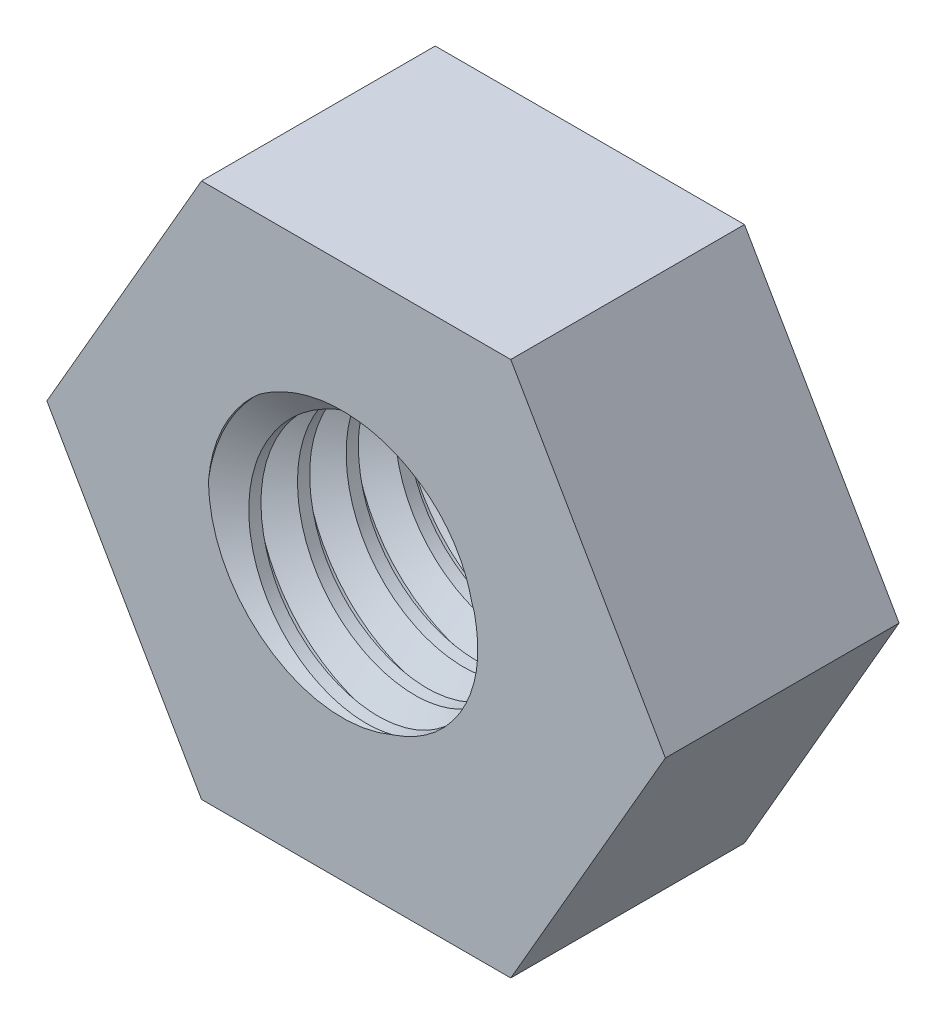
ISO-10303-21;
HEADER;
FILE_DESCRIPTION(('STEP AP214'),'2;1');
FILE_NAME('part.step','',(''),(''),'','','');
FILE_SCHEMA(('AUTOMOTIVE_DESIGN { 1 0 10303 214 1 1 1 1 }'));
ENDSEC;
DATA;
#1=APPLICATION_CONTEXT('core data for automotive mechanical design processes');
#2=APPLICATION_PROTOCOL_DEFINITION('international standard','automotive_design',2000,#1);
#3=PRODUCT_CONTEXT('',#1,'mechanical');
#4=PRODUCT('Part','Part','',(#3));
#5=PRODUCT_RELATED_PRODUCT_CATEGORY('part','',(#4));
#6=PRODUCT_DEFINITION_FORMATION('','',#4);
#7=PRODUCT_DEFINITION_CONTEXT('part definition',#1,'design');
#8=PRODUCT_DEFINITION('design','',#6,#7);
#9=PRODUCT_DEFINITION_SHAPE('','',#8);
#10=(LENGTH_UNIT() NAMED_UNIT(*) SI_UNIT(.MILLI.,.METRE.));
#11=(NAMED_UNIT(*) PLANE_ANGLE_UNIT() SI_UNIT($,.RADIAN.));
#12=(NAMED_UNIT(*) SI_UNIT($,.STERADIAN.) SOLID_ANGLE_UNIT());
#13=UNCERTAINTY_MEASURE_WITH_UNIT(LENGTH_MEASURE(1.E-05),#10,'distance_accuracy_value','');
#14=(GEOMETRIC_REPRESENTATION_CONTEXT(3) GLOBAL_UNCERTAINTY_ASSIGNED_CONTEXT((#13)) GLOBAL_UNIT_ASSIGNED_CONTEXT((#10,
#11,#12)) REPRESENTATION_CONTEXT('',''));
#15=CARTESIAN_POINT('',(0.,0.,0.));
#16=DIRECTION('',(0.,0.,1.));
#17=DIRECTION('',(1.,0.,0.));
#18=AXIS2_PLACEMENT_3D('',#15,#16,#17);
#19=CARTESIAN_POINT('',(0.,0.,0.));
#20=DIRECTION('',(0.,0.,1.));
#21=DIRECTION('',(1.,0.,0.));
#22=AXIS2_PLACEMENT_3D('',#19,#20,#21);
#23=PLANE('',#22);
#24=DIRECTION('',(0.499999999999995,0.866025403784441,0.));
#25=VECTOR('',#24,1.);
#26=CARTESIAN_POINT('',(1.5877132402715,-2.74999999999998,0.));
#27=LINE('',#26,#25);
#28=CARTESIAN_POINT('',(1.5877132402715,-2.74999999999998,0.));
#29=VERTEX_POINT('',#28);
#30=CARTESIAN_POINT('',(3.17542648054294,0.,0.));
#31=VERTEX_POINT('',#30);
#32=EDGE_CURVE('E204',#29,#31,#27,.T.);
#33=ORIENTED_EDGE('',*,*,#32,.T.);
#34=DIRECTION('',(-0.500000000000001,0.866025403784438,0.));
#35=VECTOR('',#34,1.);
#36=CARTESIAN_POINT('',(3.17542648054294,0.,0.));
#37=LINE('',#36,#35);
#38=CARTESIAN_POINT('',(1.58771324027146,2.75,0.));
#39=VERTEX_POINT('',#38);
#40=EDGE_CURVE('E359',#31,#39,#37,.T.);
#41=ORIENTED_EDGE('',*,*,#40,.T.);
#42=DIRECTION('',(-1.,0.,0.));
#43=VECTOR('',#42,1.);
#44=CARTESIAN_POINT('',(1.58771324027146,2.75,0.));
#45=LINE('',#44,#43);
#46=CARTESIAN_POINT('',(-1.58771324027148,2.74999999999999,0.));
#47=VERTEX_POINT('',#46);
#48=EDGE_CURVE('E361',#39,#47,#45,.T.);
#49=ORIENTED_EDGE('',*,*,#48,.T.);
#50=DIRECTION('',(-0.499999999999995,-0.866025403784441,0.));
#51=VECTOR('',#50,1.);
#52=CARTESIAN_POINT('',(-1.58771324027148,2.74999999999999,0.));
#53=LINE('',#52,#51);
#54=CARTESIAN_POINT('',(-3.17542648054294,0.,0.));
#55=VERTEX_POINT('',#54);
#56=EDGE_CURVE('E366',#47,#55,#53,.T.);
#57=ORIENTED_EDGE('',*,*,#56,.T.);
#58=DIRECTION('',(0.500000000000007,-0.866025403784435,0.));
#59=VECTOR('',#58,1.);
#60=CARTESIAN_POINT('',(-3.17542648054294,0.,0.));
#61=LINE('',#60,#59);
#62=CARTESIAN_POINT('',(-1.58771324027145,-2.75000000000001,0.));
#63=VERTEX_POINT('',#62);
#64=EDGE_CURVE('E368',#55,#63,#61,.T.);
#65=ORIENTED_EDGE('',*,*,#64,.T.);
#66=DIRECTION('',(1.,0.,0.));
#67=VECTOR('',#66,1.);
#68=CARTESIAN_POINT('',(-1.58771324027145,-2.75000000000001,0.));
#69=LINE('',#68,#67);
#70=EDGE_CURVE('E336',#63,#29,#69,.T.);
#71=ORIENTED_EDGE('',*,*,#70,.T.);
#72=EDGE_LOOP('',(#33,#41,#49,#57,#65,#71));
#73=FACE_BOUND('',#72,.T.);
#74=CARTESIAN_POINT('',(0.,0.,1.2E-05));
#75=DIRECTION('',(0.,0.,1.));
#76=DIRECTION('',(0.304506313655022,-0.952510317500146,0.));
#77=AXIS2_PLACEMENT_3D('',#74,#75,#76);
#78=CIRCLE('',#77,1.25);
#79=CARTESIAN_POINT('',(0.381170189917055,-1.19235645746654,6.E-06));
#80=VERTEX_POINT('',#79);
#81=CARTESIAN_POINT('',(1.2116082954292,0.310218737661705,-0.00298809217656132));
#82=VERTEX_POINT('',#81);
#83=EDGE_CURVE('E154',#80,#82,#78,.T.);
#84=ORIENTED_EDGE('',*,*,#83,.F.);
#85=CARTESIAN_POINT('',(0.374999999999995,-1.19242400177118,0.));
#86=CARTESIAN_POINT('',(0.341909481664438,-1.20697929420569,0.));
#87=CARTESIAN_POINT('',(0.308221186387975,-1.22013208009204,0.));
#88=CARTESIAN_POINT('',(0.239858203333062,-1.24355585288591,0.));
#89=CARTESIAN_POINT('',(0.205183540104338,-1.25382691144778,0.));
#90=CARTESIAN_POINT('',(0.100047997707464,-1.28018906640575,0.));
#91=CARTESIAN_POINT('',(0.0284212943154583,-1.29185296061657,0.));
#92=CARTESIAN_POINT('',(-0.115756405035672,-1.30299076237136,0.));
#93=CARTESIAN_POINT('',(-0.18830777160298,-1.30245961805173,0.));
#94=CARTESIAN_POINT('',(-0.332269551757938,-1.28922624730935,0.));
#95=CARTESIAN_POINT('',(-0.403680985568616,-1.27653560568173,0.));
#96=CARTESIAN_POINT('',(-0.508388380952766,-1.24871655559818,0.));
#97=CARTESIAN_POINT('',(-0.542908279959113,-1.2379710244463,0.));
#98=CARTESIAN_POINT('',(-0.610934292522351,-1.21360383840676,0.));
#99=CARTESIAN_POINT('',(-0.644440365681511,-1.19998206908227,0.));
#100=CARTESIAN_POINT('',(-0.693780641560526,-1.17752233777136,0.));
#101=CARTESIAN_POINT('',(-0.710083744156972,-1.16969261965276,0.));
#102=CARTESIAN_POINT('',(-0.742389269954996,-1.15343530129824,0.));
#103=CARTESIAN_POINT('',(-0.758391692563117,-1.14500769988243,0.));
#104=CARTESIAN_POINT('',(-0.80590270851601,-1.11882077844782,0.));
#105=CARTESIAN_POINT('',(-0.836917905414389,-1.10015603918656,0.));
#106=CARTESIAN_POINT('',(-0.899017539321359,-1.05950560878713,0.));
#107=CARTESIAN_POINT('',(-0.93002206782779,-1.0373978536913,0.));
#108=CARTESIAN_POINT('',(-0.990163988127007,-0.99079047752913,0.));
#109=CARTESIAN_POINT('',(-1.01930149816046,-0.966291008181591,0.));
#110=CARTESIAN_POINT('',(-1.10359926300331,-0.889454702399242,0.));
#111=CARTESIAN_POINT('',(-1.1557333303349,-0.83372189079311,0.));
#112=CARTESIAN_POINT('',(-1.253186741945,-0.711287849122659,0.));
#113=CARTESIAN_POINT('',(-1.29794290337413,-0.644140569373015,0.));
#114=CARTESIAN_POINT('',(-1.37559699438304,-0.503189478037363,0.));
#115=CARTESIAN_POINT('',(-1.40848606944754,-0.429380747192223,3.22844523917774E-13));
#116=CARTESIAN_POINT('',(-1.44839383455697,-0.314777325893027,1.80882882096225E-13));
#117=CARTESIAN_POINT('',(-1.46018408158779,-0.275578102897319,0.));
#118=CARTESIAN_POINT('',(-1.48037670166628,-0.196295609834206,0.));
#119=CARTESIAN_POINT('',(-1.48877873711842,-0.156212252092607,0.));
#120=CARTESIAN_POINT('',(-1.49879562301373,-0.0956705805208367,0.));
#121=CARTESIAN_POINT('',(-1.50170383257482,-0.0754170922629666,0.));
#122=CARTESIAN_POINT('',(-1.50664288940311,-0.0348022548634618,0.));
#123=CARTESIAN_POINT('',(-1.50867369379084,-0.0144409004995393,0.));
#124=CARTESIAN_POINT('',(-1.51351923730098,0.0467304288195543,0.));
#125=CARTESIAN_POINT('',(-1.51508982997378,0.0876445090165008,0.));
#126=CARTESIAN_POINT('',(-1.51518973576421,0.128548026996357,0.));
#127=B_SPLINE_CURVE_WITH_KNOTS('',3,(#85,#86,#87,#88,#89,#90,#91,#92,#93,#94,#95,#96,#97,#98,
#99,#100,#101,#102,#103,#104,#105,#106,#107,#108,#109,#110,#111,#112,#113,#114,#115,#116,#117,
#118,#119,#120,#121,#122,#123,#124,#125,#126),.UNSPECIFIED.,.F.,.F.,(4,2,2,2,2,2,2,2,2,2,2,2,2,
2,2,2,2,2,2,2,4),(0.,0.108383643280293,0.216764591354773,0.433350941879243,0.650027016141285,
0.866496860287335,0.974855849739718,1.08321915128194,1.13746578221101,1.19171252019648,
1.30019660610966,1.41430961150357,1.52841538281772,1.7563127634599,1.99729587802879,
2.23845842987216,2.36114006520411,2.48383392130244,2.54520179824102,2.60657267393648,
2.7292634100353),.UNSPECIFIED.);
#128=CARTESIAN_POINT('',(-1.51518973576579,0.128548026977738,9.26875879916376E-13));
#129=VERTEX_POINT('',#128);
#130=EDGE_CURVE('E12',#80,#129,#127,.T.);
#131=ORIENTED_EDGE('',*,*,#130,.T.);
#132=CARTESIAN_POINT('',(-1.51518973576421,0.128548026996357,0.));
#133=CARTESIAN_POINT('',(-1.51342691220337,0.149315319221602,0.));
#134=CARTESIAN_POINT('',(-1.51123917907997,0.170039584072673,0.));
#135=CARTESIAN_POINT('',(-1.50600909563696,0.211419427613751,0.));
#136=CARTESIAN_POINT('',(-1.50296515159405,0.232074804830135,0.));
#137=CARTESIAN_POINT('',(-1.48539819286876,0.336305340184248,0.));
#138=CARTESIAN_POINT('',(-1.46426590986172,0.418878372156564,0.));
#139=CARTESIAN_POINT('',(-1.40850810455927,0.579353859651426,0.));
#140=CARTESIAN_POINT('',(-1.3738763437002,0.657254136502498,0.));
#141=CARTESIAN_POINT('',(-1.31185620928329,0.770260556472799,0.));
#142=CARTESIAN_POINT('',(-1.28900496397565,0.807916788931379,0.));
#143=CARTESIAN_POINT('',(-1.24015050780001,0.881068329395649,0.));
#144=CARTESIAN_POINT('',(-1.21415136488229,0.916566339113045,0.));
#145=CARTESIAN_POINT('',(-1.15830143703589,0.986265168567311,0.));
#146=CARTESIAN_POINT('',(-1.12835448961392,1.02038888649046,0.));
#147=CARTESIAN_POINT('',(-1.06549369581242,1.08587042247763,0.));
#148=CARTESIAN_POINT('',(-1.03257601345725,1.11722455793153,0.));
#149=CARTESIAN_POINT('',(-0.998314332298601,1.14703662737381,0.));
#150=B_SPLINE_CURVE_WITH_KNOTS('',3,(#132,#133,#134,#135,#136,#137,#138,#139,#140,#141,#142,
#143,#144,#145,#146,#147,#148,#149),.UNSPECIFIED.,.F.,.F.,(4,2,2,2,2,2,2,2,4),(0.,
0.0625076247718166,0.125132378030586,0.37951501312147,0.634015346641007,0.766015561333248,
0.897846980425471,1.03386893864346,1.17006912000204),.UNSPECIFIED.);
#151=CARTESIAN_POINT('',(-0.99831433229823,1.14703662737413,0.));
#152=VERTEX_POINT('',#151);
#153=EDGE_CURVE('E64',#129,#152,#150,.T.);
#154=ORIENTED_EDGE('',*,*,#153,.T.);
#155=CARTESIAN_POINT('',(-0.998314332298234,1.14703662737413,0.));
#156=CARTESIAN_POINT('',(-0.963335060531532,1.17237662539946,0.));
#157=CARTESIAN_POINT('',(-0.927288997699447,1.19625225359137,0.));
#158=CARTESIAN_POINT('',(-0.853313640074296,1.24095946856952,0.));
#159=CARTESIAN_POINT('',(-0.81538276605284,1.26178844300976,0.));
#160=CARTESIAN_POINT('',(-0.757293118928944,1.29063666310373,0.));
#161=CARTESIAN_POINT('',(-0.737723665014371,1.29985645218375,0.));
#162=CARTESIAN_POINT('',(-0.698182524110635,1.31738734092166,0.));
#163=CARTESIAN_POINT('',(-0.678210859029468,1.32569848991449,0.));
#164=CARTESIAN_POINT('',(-0.617774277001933,1.3492468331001,0.));
#165=CARTESIAN_POINT('',(-0.576764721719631,1.36311041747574,0.));
#166=CARTESIAN_POINT('',(-0.494597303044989,1.38676303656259,0.));
#167=CARTESIAN_POINT('',(-0.453463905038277,1.39663736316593,0.));
#168=CARTESIAN_POINT('',(-0.370485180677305,1.41268023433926,0.));
#169=CARTESIAN_POINT('',(-0.328639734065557,1.41884814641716,0.));
#170=CARTESIAN_POINT('',(-0.20264571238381,1.43167720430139,0.));
#171=CARTESIAN_POINT('',(-0.117847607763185,1.43271869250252,0.));
#172=CARTESIAN_POINT('',(0.0457878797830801,1.42007452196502,0.));
#173=CARTESIAN_POINT('',(0.124693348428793,1.40720943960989,0.));
#174=CARTESIAN_POINT('',(0.279355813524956,1.3683603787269,0.));
#175=CARTESIAN_POINT('',(0.355109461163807,1.34236281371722,0.));
#176=CARTESIAN_POINT('',(0.46456193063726,1.29414908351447,0.));
#177=CARTESIAN_POINT('',(0.500357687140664,1.27653637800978,0.));
#178=CARTESIAN_POINT('',(0.570350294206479,1.2383541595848,0.));
#179=CARTESIAN_POINT('',(0.604547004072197,1.21778438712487,0.));
#180=CARTESIAN_POINT('',(0.671058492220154,1.17385822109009,0.));
#181=CARTESIAN_POINT('',(0.703375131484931,1.15050465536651,0.));
#182=CARTESIAN_POINT('',(0.76564651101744,1.10084108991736,0.));
#183=CARTESIAN_POINT('',(0.795601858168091,1.07453185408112,0.));
#184=CARTESIAN_POINT('',(0.851834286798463,1.02029379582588,0.));
#185=CARTESIAN_POINT('',(0.878208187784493,0.992465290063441,0.));
#186=CARTESIAN_POINT('',(0.928340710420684,0.934550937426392,0.));
#187=CARTESIAN_POINT('',(0.952098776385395,0.904464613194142,0.));
#188=CARTESIAN_POINT('',(1.01913926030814,0.811170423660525,0.));
#189=CARTESIAN_POINT('',(1.05825367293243,0.74486388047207,0.));
#190=CARTESIAN_POINT('',(1.11221698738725,0.631012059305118,0.));
#191=CARTESIAN_POINT('',(1.13075154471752,0.585156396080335,0.));
#192=CARTESIAN_POINT('',(1.16233961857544,0.491698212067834,0.));
#193=CARTESIAN_POINT('',(1.17540416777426,0.444099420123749,0.));
#194=CARTESIAN_POINT('',(1.18566016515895,0.395866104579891,0.));
#195=B_SPLINE_CURVE_WITH_KNOTS('',3,(#155,#156,#157,#158,#159,#160,#161,#162,#163,#164,#165,
#166,#167,#168,#169,#170,#171,#172,#173,#174,#175,#176,#177,#178,#179,#180,#181,#182,#183,#184,
#185,#186,#187,#188,#189,#190,#191,#192,#193,#194),.UNSPECIFIED.,.F.,.F.,(4,2,2,2,2,2,2,2,2,2,2,
2,2,2,2,2,2,2,2,4),(0.,0.129553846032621,0.259218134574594,0.324097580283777,0.388973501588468,
0.518648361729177,0.645381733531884,0.772136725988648,1.02505637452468,1.26382771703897,
1.50284659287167,1.62241233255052,1.741988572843,1.86144436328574,1.98086935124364,
2.0957304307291,2.21061586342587,2.44011650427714,2.58819646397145,2.73597629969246),.UNSPECIFIED.);
#196=CARTESIAN_POINT('',(1.18366689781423,0.405069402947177,0.));
#197=VERTEX_POINT('',#196);
#198=EDGE_CURVE('E183',#152,#197,#195,.T.);
#199=ORIENTED_EDGE('',*,*,#198,.T.);
#200=CARTESIAN_POINT('',(1.20104559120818,0.30873068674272,0.));
#201=CARTESIAN_POINT('',(1.19876768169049,0.324898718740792,0.));
#202=CARTESIAN_POINT('',(1.19618050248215,0.3410109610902,0.));
#203=CARTESIAN_POINT('',(1.19038760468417,0.373123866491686,0.));
#204=CARTESIAN_POINT('',(1.18718188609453,0.389124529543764,0.));
#205=CARTESIAN_POINT('',(1.18366689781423,0.405069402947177,0.));
#206=B_SPLINE_CURVE_WITH_KNOTS('',3,(#200,#201,#202,#203,#204,#205),.UNSPECIFIED.,.F.,.F.,(4,2,
4),(0.,0.0489559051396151,0.0979118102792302),.UNSPECIFIED.);
#207=EDGE_CURVE('E72',#82,#197,#206,.T.);
#208=ORIENTED_EDGE('',*,*,#207,.F.);
#209=EDGE_LOOP('',(#84,#131,#154,#199,#208));
#210=FACE_BOUND('',#209,.T.);
#211=ADVANCED_FACE('F50',(#73,#210),#23,.T.);
#212=CARTESIAN_POINT('',(1.5877132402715,-2.74999999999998,-2.4));
#213=DIRECTION('',(0.866025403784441,-0.499999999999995,0.));
#214=DIRECTION('',(0.499999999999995,0.866025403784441,0.));
#215=AXIS2_PLACEMENT_3D('',#212,#213,#214);
#216=PLANE('',#215);
#217=ORIENTED_EDGE('',*,*,#32,.F.);
#218=DIRECTION('',(0.,0.,1.));
#219=VECTOR('',#218,1.);
#220=CARTESIAN_POINT('',(1.5877132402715,-2.74999999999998,-2.4));
#221=LINE('',#220,#219);
#222=CARTESIAN_POINT('',(1.5877132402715,-2.74999999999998,-2.4));
#223=VERTEX_POINT('',#222);
#224=EDGE_CURVE('E328',#223,#29,#221,.T.);
#225=ORIENTED_EDGE('',*,*,#224,.F.);
#226=DIRECTION('',(0.499999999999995,0.866025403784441,0.));
#227=VECTOR('',#226,1.);
#228=CARTESIAN_POINT('',(1.5877132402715,-2.74999999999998,-2.4));
#229=LINE('',#228,#227);
#230=CARTESIAN_POINT('',(3.17542648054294,0.,-2.4));
#231=VERTEX_POINT('',#230);
#232=EDGE_CURVE('E192',#223,#231,#229,.T.);
#233=ORIENTED_EDGE('',*,*,#232,.T.);
#234=DIRECTION('',(0.,0.,1.));
#235=VECTOR('',#234,1.);
#236=CARTESIAN_POINT('',(3.17542648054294,0.,-2.4));
#237=LINE('',#236,#235);
#238=EDGE_CURVE('E343',#231,#31,#237,.T.);
#239=ORIENTED_EDGE('',*,*,#238,.T.);
#240=EDGE_LOOP('',(#217,#225,#233,#239));
#241=FACE_BOUND('',#240,.T.);
#242=ADVANCED_FACE('F47',(#241),#216,.T.);
#243=CARTESIAN_POINT('',(-1.58771324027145,-2.75000000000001,-2.4));
#244=DIRECTION('',(0.,-1.,0.));
#245=DIRECTION('',(1.,0.,0.));
#246=AXIS2_PLACEMENT_3D('',#243,#244,#245);
#247=PLANE('',#246);
#248=ORIENTED_EDGE('',*,*,#70,.F.);
#249=DIRECTION('',(0.,0.,1.));
#250=VECTOR('',#249,1.);
#251=CARTESIAN_POINT('',(-1.58771324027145,-2.75000000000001,-2.4));
#252=LINE('',#251,#250);
#253=CARTESIAN_POINT('',(-1.58771324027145,-2.75000000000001,-2.4));
#254=VERTEX_POINT('',#253);
#255=EDGE_CURVE('E327',#254,#63,#252,.T.);
#256=ORIENTED_EDGE('',*,*,#255,.F.);
#257=DIRECTION('',(1.,0.,0.));
#258=VECTOR('',#257,1.);
#259=CARTESIAN_POINT('',(-1.58771324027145,-2.75000000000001,-2.4));
#260=LINE('',#259,#258);
#261=EDGE_CURVE('E346',#254,#223,#260,.T.);
#262=ORIENTED_EDGE('',*,*,#261,.T.);
#263=ORIENTED_EDGE('',*,*,#224,.T.);
#264=EDGE_LOOP('',(#248,#256,#262,#263));
#265=FACE_BOUND('',#264,.T.);
#266=ADVANCED_FACE('F276',(#265),#247,.T.);
#267=CARTESIAN_POINT('',(-3.17542648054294,0.,-2.4));
#268=DIRECTION('',(-0.866025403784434,-0.500000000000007,0.));
#269=DIRECTION('',(0.500000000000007,-0.866025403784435,0.));
#270=AXIS2_PLACEMENT_3D('',#267,#268,#269);
#271=PLANE('',#270);
#272=ORIENTED_EDGE('',*,*,#64,.F.);
#273=DIRECTION('',(0.,0.,1.));
#274=VECTOR('',#273,1.);
#275=CARTESIAN_POINT('',(-3.17542648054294,0.,-2.4));
#276=LINE('',#275,#274);
#277=CARTESIAN_POINT('',(-3.17542648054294,0.,-2.4));
#278=VERTEX_POINT('',#277);
#279=EDGE_CURVE('E331',#278,#55,#276,.T.);
#280=ORIENTED_EDGE('',*,*,#279,.F.);
#281=DIRECTION('',(0.500000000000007,-0.866025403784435,0.));
#282=VECTOR('',#281,1.);
#283=CARTESIAN_POINT('',(-3.17542648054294,0.,-2.4));
#284=LINE('',#283,#282);
#285=EDGE_CURVE('E349',#278,#254,#284,.T.);
#286=ORIENTED_EDGE('',*,*,#285,.T.);
#287=ORIENTED_EDGE('',*,*,#255,.T.);
#288=EDGE_LOOP('',(#272,#280,#286,#287));
#289=FACE_BOUND('',#288,.T.);
#290=ADVANCED_FACE('F397',(#289),#271,.T.);
#291=CARTESIAN_POINT('',(-1.58771324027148,2.74999999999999,-2.4));
#292=DIRECTION('',(-0.866025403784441,0.499999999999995,0.));
#293=DIRECTION('',(-0.499999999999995,-0.866025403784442,0.));
#294=AXIS2_PLACEMENT_3D('',#291,#292,#293);
#295=PLANE('',#294);
#296=ORIENTED_EDGE('',*,*,#56,.F.);
#297=DIRECTION('',(0.,0.,1.));
#298=VECTOR('',#297,1.);
#299=CARTESIAN_POINT('',(-1.58771324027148,2.74999999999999,-2.4));
#300=LINE('',#299,#298);
#301=CARTESIAN_POINT('',(-1.58771324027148,2.74999999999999,-2.4));
#302=VERTEX_POINT('',#301);
#303=EDGE_CURVE('E345',#302,#47,#300,.T.);
#304=ORIENTED_EDGE('',*,*,#303,.F.);
#305=DIRECTION('',(-0.499999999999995,-0.866025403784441,0.));
#306=VECTOR('',#305,1.);
#307=CARTESIAN_POINT('',(-1.58771324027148,2.74999999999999,-2.4));
#308=LINE('',#307,#306);
#309=EDGE_CURVE('E354',#302,#278,#308,.T.);
#310=ORIENTED_EDGE('',*,*,#309,.T.);
#311=ORIENTED_EDGE('',*,*,#279,.T.);
#312=EDGE_LOOP('',(#296,#304,#310,#311));
#313=FACE_BOUND('',#312,.T.);
#314=ADVANCED_FACE('F381',(#313),#295,.T.);
#315=CARTESIAN_POINT('',(1.58771324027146,2.75,-2.4));
#316=DIRECTION('',(0.,1.,0.));
#317=DIRECTION('',(-1.,0.,0.));
#318=AXIS2_PLACEMENT_3D('',#315,#316,#317);
#319=PLANE('',#318);
#320=ORIENTED_EDGE('',*,*,#48,.F.);
#321=DIRECTION('',(0.,0.,1.));
#322=VECTOR('',#321,1.);
#323=CARTESIAN_POINT('',(1.58771324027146,2.75,-2.4));
#324=LINE('',#323,#322);
#325=CARTESIAN_POINT('',(1.58771324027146,2.75,-2.4));
#326=VERTEX_POINT('',#325);
#327=EDGE_CURVE('E341',#326,#39,#324,.T.);
#328=ORIENTED_EDGE('',*,*,#327,.F.);
#329=DIRECTION('',(-1.,0.,0.));
#330=VECTOR('',#329,1.);
#331=CARTESIAN_POINT('',(1.58771324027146,2.75,-2.4));
#332=LINE('',#331,#330);
#333=EDGE_CURVE('E374',#326,#302,#332,.T.);
#334=ORIENTED_EDGE('',*,*,#333,.T.);
#335=ORIENTED_EDGE('',*,*,#303,.T.);
#336=EDGE_LOOP('',(#320,#328,#334,#335));
#337=FACE_BOUND('',#336,.T.);
#338=ADVANCED_FACE('F388',(#337),#319,.T.);
#339=CARTESIAN_POINT('',(3.17542648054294,0.,-2.4));
#340=DIRECTION('',(0.866025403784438,0.500000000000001,0.));
#341=DIRECTION('',(-0.500000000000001,0.866025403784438,0.));
#342=AXIS2_PLACEMENT_3D('',#339,#340,#341);
#343=PLANE('',#342);
#344=ORIENTED_EDGE('',*,*,#40,.F.);
#345=ORIENTED_EDGE('',*,*,#238,.F.);
#346=DIRECTION('',(-0.500000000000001,0.866025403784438,0.));
#347=VECTOR('',#346,1.);
#348=CARTESIAN_POINT('',(3.17542648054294,0.,-2.4));
#349=LINE('',#348,#347);
#350=EDGE_CURVE('E375',#231,#326,#349,.T.);
#351=ORIENTED_EDGE('',*,*,#350,.T.);
#352=ORIENTED_EDGE('',*,*,#327,.T.);
#353=EDGE_LOOP('',(#344,#345,#351,#352));
#354=FACE_BOUND('',#353,.T.);
#355=ADVANCED_FACE('F391',(#354),#343,.T.);
#356=CARTESIAN_POINT('',(0.,0.,-2.4));
#357=DIRECTION('',(0.,0.,1.));
#358=DIRECTION('',(1.,0.,0.));
#359=AXIS2_PLACEMENT_3D('',#356,#357,#358);
#360=PLANE('',#359);
#361=CARTESIAN_POINT('',(0.,0.,-2.4));
#362=DIRECTION('',(0.,0.,1.));
#363=DIRECTION('',(1.,0.,0.));
#364=AXIS2_PLACEMENT_3D('',#361,#362,#363);
#365=CIRCLE('',#364,1.25);
#366=CARTESIAN_POINT('',(1.25,0.,-2.4));
#367=VERTEX_POINT('',#366);
#368=EDGE_CURVE('E159',#367,#367,#365,.T.);
#369=ORIENTED_EDGE('',*,*,#368,.T.);
#370=EDGE_LOOP('',(#369));
#371=FACE_BOUND('',#370,.T.);
#372=ORIENTED_EDGE('',*,*,#232,.F.);
#373=ORIENTED_EDGE('',*,*,#261,.F.);
#374=ORIENTED_EDGE('',*,*,#285,.F.);
#375=ORIENTED_EDGE('',*,*,#309,.F.);
#376=ORIENTED_EDGE('',*,*,#333,.F.);
#377=ORIENTED_EDGE('',*,*,#350,.F.);
#378=EDGE_LOOP('',(#372,#373,#374,#375,#376,#377));
#379=FACE_BOUND('',#378,.T.);
#380=ADVANCED_FACE('F172',(#371,#379),#360,.F.);
#381=CARTESIAN_POINT('',(0.,0.,1.2E-05));
#382=DIRECTION('',(0.,0.,-1.));
#383=DIRECTION('',(-1.,0.,0.));
#384=AXIS2_PLACEMENT_3D('',#381,#382,#383);
#385=CYLINDRICAL_SURFACE('',#384,1.25);
#386=CARTESIAN_POINT('',(1.25,0.,-2.02500000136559));
#387=CARTESIAN_POINT('',(1.25,0.721687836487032,-1.98333333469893));
#388=CARTESIAN_POINT('',(0.625,1.08253175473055,-1.94166666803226));
#389=CARTESIAN_POINT('',(0.,1.44337567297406,-1.90000000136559));
#390=CARTESIAN_POINT('',(-0.625,1.08253175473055,-1.85833333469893));
#391=CARTESIAN_POINT('',(-1.25,0.721687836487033,-1.81666666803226));
#392=CARTESIAN_POINT('',(-1.25,0.,-1.77500000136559));
#393=CARTESIAN_POINT('',(-1.25,-0.721687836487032,-1.73333333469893));
#394=CARTESIAN_POINT('',(-0.625000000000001,-1.08253175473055,-1.69166666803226));
#395=CARTESIAN_POINT('',(0.,-1.44337567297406,-1.65000000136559));
#396=CARTESIAN_POINT('',(0.624999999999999,-1.08253175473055,-1.60833333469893));
#397=CARTESIAN_POINT('',(1.25,-0.721687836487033,-1.56666666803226));
#398=CARTESIAN_POINT('',(1.25,0.,-1.52500000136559));
#399=CARTESIAN_POINT('',(1.25,0.721687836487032,-1.48333333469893));
#400=CARTESIAN_POINT('',(0.625,1.08253175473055,-1.44166666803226));
#401=CARTESIAN_POINT('',(0.,1.44337567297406,-1.40000000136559));
#402=CARTESIAN_POINT('',(-0.625,1.08253175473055,-1.35833333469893));
#403=CARTESIAN_POINT('',(-1.25,0.721687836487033,-1.31666666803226));
#404=CARTESIAN_POINT('',(-1.25,0.,-1.27500000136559));
#405=CARTESIAN_POINT('',(-1.25,-0.721687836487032,-1.23333333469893));
#406=CARTESIAN_POINT('',(-0.625000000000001,-1.08253175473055,-1.19166666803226));
#407=CARTESIAN_POINT('',(0.,-1.44337567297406,-1.15000000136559));
#408=CARTESIAN_POINT('',(0.624999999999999,-1.08253175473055,-1.10833333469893));
#409=CARTESIAN_POINT('',(1.25,-0.721687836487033,-1.06666666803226));
#410=CARTESIAN_POINT('',(1.25,0.,-1.02500000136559));
#411=CARTESIAN_POINT('',(1.25,0.721687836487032,-0.983333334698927));
#412=CARTESIAN_POINT('',(0.625,1.08253175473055,-0.94166666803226));
#413=CARTESIAN_POINT('',(0.,1.44337567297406,-0.900000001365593));
#414=CARTESIAN_POINT('',(-0.625,1.08253175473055,-0.858333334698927));
#415=CARTESIAN_POINT('',(-1.25,0.721687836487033,-0.81666666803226));
#416=CARTESIAN_POINT('',(-1.25,0.,-0.775000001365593));
#417=CARTESIAN_POINT('',(-1.25,-0.721687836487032,-0.733333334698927));
#418=CARTESIAN_POINT('',(-0.625000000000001,-1.08253175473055,-0.69166666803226));
#419=CARTESIAN_POINT('',(0.,-1.44337567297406,-0.650000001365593));
#420=CARTESIAN_POINT('',(0.624999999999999,-1.08253175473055,-0.608333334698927));
#421=CARTESIAN_POINT('',(1.25,-0.721687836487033,-0.56666666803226));
#422=CARTESIAN_POINT('',(1.25,0.,-0.525000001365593));
#423=CARTESIAN_POINT('',(1.25,0.721687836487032,-0.483333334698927));
#424=CARTESIAN_POINT('',(0.625,1.08253175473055,-0.44166666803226));
#425=CARTESIAN_POINT('',(0.,1.44337567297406,-0.400000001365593));
#426=CARTESIAN_POINT('',(-0.625,1.08253175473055,-0.358333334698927));
#427=CARTESIAN_POINT('',(-1.25,0.721687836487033,-0.31666666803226));
#428=CARTESIAN_POINT('',(-1.25,0.,-0.275000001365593));
#429=CARTESIAN_POINT('',(-1.25,-0.721687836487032,-0.233333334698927));
#430=CARTESIAN_POINT('',(-0.625000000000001,-1.08253175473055,-0.19166666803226));
#431=CARTESIAN_POINT('',(0.,-1.44337567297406,-0.150000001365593));
#432=CARTESIAN_POINT('',(0.624999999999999,-1.08253175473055,-0.108333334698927));
#433=CARTESIAN_POINT('',(1.25,-0.721687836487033,-0.0666666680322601));
#434=CARTESIAN_POINT('',(1.25,0.,-0.0250000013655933));
#435=CARTESIAN_POINT('',(1.25,0.721687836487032,0.0166666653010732));
#436=CARTESIAN_POINT('',(0.625,1.08253175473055,0.05833333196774));
#437=CARTESIAN_POINT('',(0.,1.44337567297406,0.0999999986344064));
#438=CARTESIAN_POINT('',(-0.625,1.08253175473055,0.141666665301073));
#439=CARTESIAN_POINT('',(-1.25,0.721687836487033,0.18333333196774));
#440=CARTESIAN_POINT('',(-1.25,0.,0.224999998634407));
#441=CARTESIAN_POINT('',(-1.25,-0.721687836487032,0.266666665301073));
#442=CARTESIAN_POINT('',(-0.625000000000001,-1.08253175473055,0.30833333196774));
#443=CARTESIAN_POINT('',(-0.143042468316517,-1.36079006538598,0.340463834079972));
#444=CARTESIAN_POINT('',(0.386240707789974,-1.18883056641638,0.375749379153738));
#445=(BOUNDED_CURVE() B_SPLINE_CURVE(2,(#386,#387,#388,#389,#390,#391,#392,#393,#394,#395,#396,
#397,#398,#399,#400,#401,#402,#403,#404,#405,#406,#407,#408,#409,#410,#411,#412,#413,#414,#415,
#416,#417,#418,#419,#420,#421,#422,#423,#424,#425,#426,#427,#428,#429,#430,#431,#432,#433,#434,
#435,#436,#437,#438,#439,#440,#441,#442,#443,#444),.UNSPECIFIED.,.F.,
.F.) B_SPLINE_CURVE_WITH_KNOTS((3,2,2,2,2,2,2,2,2,2,2,2,2,2,2,2,2,2,2,2,2,2,2,2,2,2,2,2,2,3),
(0.,0.0333333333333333,0.0666666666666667,0.1,0.133333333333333,0.166666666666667,0.2,
0.233333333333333,0.266666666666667,0.3,0.333333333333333,0.366666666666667,0.4,
0.433333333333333,0.466666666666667,0.5,0.533333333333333,0.566666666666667,0.6,
0.633333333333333,0.666666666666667,0.7,0.733333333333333,0.766666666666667,0.8,
0.833333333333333,0.866666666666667,0.9,0.933333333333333,0.959850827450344),
.UNSPECIFIED.) CURVE() GEOMETRIC_REPRESENTATION_ITEM() RATIONAL_B_SPLINE_CURVE((1.,
0.866025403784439,1.,0.866025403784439,1.,0.866025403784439,1.,0.866025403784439,1.,
0.866025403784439,1.,0.866025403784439,1.,0.866025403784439,1.,0.866025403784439,1.,
0.866025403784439,1.,0.866025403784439,1.,0.866025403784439,1.,0.866025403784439,1.,
0.866025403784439,1.,0.866025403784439,1.,0.866025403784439,1.,0.866025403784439,1.,
0.866025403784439,1.,0.866025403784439,1.,0.866025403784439,1.,0.866025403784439,1.,
0.866025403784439,1.,0.866025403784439,1.,0.866025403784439,1.,0.866025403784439,1.,
0.866025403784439,1.,0.866025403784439,1.,0.866025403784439,1.,0.866025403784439,1.,
0.893419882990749,0.956414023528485)) REPRESENTATION_ITEM(''));
#446=CARTESIAN_POINT('',(1.25,0.,-2.02500000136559));
#447=VERTEX_POINT('',#446);
#448=EDGE_CURVE('E135',#447,#82,#445,.T.);
#449=ORIENTED_EDGE('',*,*,#448,.F.);
#450=DIRECTION('',(0.,0.,-1.));
#451=VECTOR('',#450,1.);
#452=CARTESIAN_POINT('',(1.25,0.,1.2E-05));
#453=LINE('',#452,#451);
#454=EDGE_CURVE('E141',#447,#367,#453,.T.);
#455=ORIENTED_EDGE('',*,*,#454,.T.);
#456=ORIENTED_EDGE('',*,*,#368,.F.);
#457=CARTESIAN_POINT('',(1.25,0.,-2.4));
#458=CARTESIAN_POINT('',(1.25002456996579,0.0589110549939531,-2.39659969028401));
#459=CARTESIAN_POINT('',(1.2458359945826,0.117792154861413,-2.39306051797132));
#460=CARTESIAN_POINT('',(1.22923126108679,0.234403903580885,-2.38577434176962));
#461=CARTESIAN_POINT('',(1.21681055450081,0.292133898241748,-2.38202722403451));
#462=CARTESIAN_POINT('',(1.18074713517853,0.416278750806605,-2.37365782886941));
#463=CARTESIAN_POINT('',(1.15539280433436,0.482201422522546,-2.36900697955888));
#464=CARTESIAN_POINT('',(1.09396826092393,0.608841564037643,-2.35964699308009));
#465=CARTESIAN_POINT('',(1.05789666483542,0.669558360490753,-2.35493784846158));
#466=CARTESIAN_POINT('',(0.976022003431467,0.784117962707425,-2.34559806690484));
#467=CARTESIAN_POINT('',(0.930211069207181,0.8379551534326,-2.34096749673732));
#468=CARTESIAN_POINT('',(0.830172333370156,0.937164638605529,-2.33189202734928));
#469=CARTESIAN_POINT('',(0.775944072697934,0.982536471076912,-2.32744713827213));
#470=CARTESIAN_POINT('',(0.660625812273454,1.06350042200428,-2.31897718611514));
#471=CARTESIAN_POINT('',(0.599538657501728,1.09909657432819,-2.3149519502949));
#472=CARTESIAN_POINT('',(0.472271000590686,1.15949237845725,-2.30650202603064));
#473=CARTESIAN_POINT('',(0.406090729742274,1.18429252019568,-2.30207735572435));
#474=CARTESIAN_POINT('',(0.270536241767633,1.22240146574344,-2.29303111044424));
#475=CARTESIAN_POINT('',(0.201162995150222,1.23571373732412,-2.28840959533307));
#476=CARTESIAN_POINT('',(0.0611668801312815,1.25048477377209,-2.27907906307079));
#477=CARTESIAN_POINT('',(-0.00945603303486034,1.25194311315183,-2.27437004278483));
#478=CARTESIAN_POINT('',(-0.149983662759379,1.24296750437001,-2.26500064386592));
#479=CARTESIAN_POINT('',(-0.219887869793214,1.23252563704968,-2.26034029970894));
#480=CARTESIAN_POINT('',(-0.356984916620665,1.20000756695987,-2.25120151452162));
#481=CARTESIAN_POINT('',(-0.424177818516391,1.17793163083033,-2.24672306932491));
#482=CARTESIAN_POINT('',(-0.521406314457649,1.13660938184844,-2.2402387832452));
#483=CARTESIAN_POINT('',(-0.553231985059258,1.12146105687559,-2.23811560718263));
#484=CARTESIAN_POINT('',(-0.615497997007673,1.08853220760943,-2.23396906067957));
#485=CARTESIAN_POINT('',(-0.645938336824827,1.0707516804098,-2.23194569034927));
#486=CARTESIAN_POINT('',(-0.734820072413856,1.01365120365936,-2.22571497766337));
#487=CARTESIAN_POINT('',(-0.790880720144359,0.970547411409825,-2.22134371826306));
#488=CARTESIAN_POINT('',(-0.894890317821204,0.875577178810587,-2.21238330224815));
#489=CARTESIAN_POINT('',(-0.942842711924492,0.823714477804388,-2.20779423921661));
#490=CARTESIAN_POINT('',(-1.02935063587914,0.712662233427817,-2.19850206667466));
#491=CARTESIAN_POINT('',(-1.06790597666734,0.653472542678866,-2.19379895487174));
#492=CARTESIAN_POINT('',(-1.13453618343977,0.529425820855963,-2.18441430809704));
#493=CARTESIAN_POINT('',(-1.16260456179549,0.464565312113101,-2.17973278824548));
#494=CARTESIAN_POINT('',(-1.20743309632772,0.33099832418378,-2.17053117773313));
#495=CARTESIAN_POINT('',(-1.22419346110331,0.262291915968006,-2.16601108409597));
#496=CARTESIAN_POINT('',(-1.24048683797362,0.157920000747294,-2.15943090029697));
#497=CARTESIAN_POINT('',(-1.24444324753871,0.12289652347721,-2.15727001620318));
#498=CARTESIAN_POINT('',(-1.24938761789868,0.0526244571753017,-2.15306933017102));
#499=CARTESIAN_POINT('',(-1.25037557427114,0.0173758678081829,-2.15102952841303));
#500=CARTESIAN_POINT('',(-1.24936951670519,-0.0530757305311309,-2.14690084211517));
#501=CARTESIAN_POINT('',(-1.24737551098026,-0.0882787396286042,-2.14481195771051));
#502=CARTESIAN_POINT('',(-1.24042695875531,-0.158376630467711,-2.14054080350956));
#503=CARTESIAN_POINT('',(-1.23547241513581,-0.193271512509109,-2.13835853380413));
#504=CARTESIAN_POINT('',(-1.21621504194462,-0.297088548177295,-2.13171877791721));
#505=CARTESIAN_POINT('',(-1.19751692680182,-0.365243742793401,-2.12716246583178));
#506=CARTESIAN_POINT('',(-1.14893789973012,-0.497397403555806,-2.11791475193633));
#507=CARTESIAN_POINT('',(-1.11905675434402,-0.561395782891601,-2.113223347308));
#508=CARTESIAN_POINT('',(-1.04894785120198,-0.683496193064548,-2.10383626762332));
#509=CARTESIAN_POINT('',(-1.00871442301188,-0.741594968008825,-2.09914059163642));
#510=CARTESIAN_POINT('',(-0.919010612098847,-0.850220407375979,-2.08988007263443));
#511=CARTESIAN_POINT('',(-0.86954040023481,-0.900747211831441,-2.08531522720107));
#512=CARTESIAN_POINT('',(-0.789543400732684,-0.969725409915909,-2.07866338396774));
#513=CARTESIAN_POINT('',(-0.761898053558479,-0.991591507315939,-2.07647768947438));
#514=CARTESIAN_POINT('',(-0.704849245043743,-1.03292136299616,-2.07219524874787));
#515=CARTESIAN_POINT('',(-0.675445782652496,-1.0523851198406,-2.07009850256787));
#516=CARTESIAN_POINT('',(-0.615096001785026,-1.08875987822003,-2.06596715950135));
#517=CARTESIAN_POINT('',(-0.584149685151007,-1.10567088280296,-2.06393256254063));
#518=CARTESIAN_POINT('',(-0.520955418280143,-1.13681495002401,-2.05974111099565));
#519=CARTESIAN_POINT('',(-0.488707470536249,-1.15104801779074,-2.05758425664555));
#520=CARTESIAN_POINT('',(-0.390383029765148,-1.18955525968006,-2.05101802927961));
#521=CARTESIAN_POINT('',(-0.322634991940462,-1.20969215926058,-2.04650687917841));
#522=CARTESIAN_POINT('',(-0.184764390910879,-1.23827554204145,-2.03731974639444));
#523=CARTESIAN_POINT('',(-0.11464178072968,-1.24672179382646,-2.03264376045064));
#524=CARTESIAN_POINT('',(0.0260679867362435,-1.25170864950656,-2.02326115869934));
#525=CARTESIAN_POINT('',(0.096655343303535,-1.24824376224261,-2.01855452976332));
#526=CARTESIAN_POINT('',(0.236236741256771,-1.22949368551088,-2.00925266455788));
#527=CARTESIAN_POINT('',(0.305230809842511,-1.21420869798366,-2.00465742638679));
#528=CARTESIAN_POINT('',(0.439722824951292,-1.17222045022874,-1.99567899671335));
#529=CARTESIAN_POINT('',(0.505220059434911,-1.14551487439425,-1.99129584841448));
#530=CARTESIAN_POINT('',(0.599352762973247,-1.09750733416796,-1.98505456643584));
#531=CARTESIAN_POINT('',(0.630057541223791,-1.0801704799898,-1.98302888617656));
#532=CARTESIAN_POINT('',(0.689891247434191,-1.04297228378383,-1.97888585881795));
#533=CARTESIAN_POINT('',(0.719020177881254,-1.02311094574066,-1.9767685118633));
#534=CARTESIAN_POINT('',(0.803676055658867,-0.959972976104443,-1.97030183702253));
#535=CARTESIAN_POINT('',(0.856570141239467,-0.913092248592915,-1.96583171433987));
#536=CARTESIAN_POINT('',(0.953687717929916,-0.81113699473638,-1.95670811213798));
#537=CARTESIAN_POINT('',(0.997911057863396,-0.756062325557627,-1.95205462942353));
#538=CARTESIAN_POINT('',(1.07648906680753,-0.639238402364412,-1.94268975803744));
#539=CARTESIAN_POINT('',(1.11084023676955,-0.577486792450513,-1.93797834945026));
#540=CARTESIAN_POINT('',(1.16866715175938,-0.449083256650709,-1.92864045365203));
#541=CARTESIAN_POINT('',(1.1921430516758,-0.382431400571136,-1.92401396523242));
#542=CARTESIAN_POINT('',(1.22755917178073,-0.246091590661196,-1.91495041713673));
#543=CARTESIAN_POINT('',(1.23949535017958,-0.176402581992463,-1.91051342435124));
#544=CARTESIAN_POINT('',(1.25146659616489,-0.0359852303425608,-1.9020500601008));
#545=CARTESIAN_POINT('',(1.25150168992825,0.0347431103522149,-1.89802368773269));
#546=CARTESIAN_POINT('',(1.23967393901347,0.175123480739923,-1.88956549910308));
#547=CARTESIAN_POINT('',(1.22781933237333,0.244776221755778,-1.88513396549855));
#548=CARTESIAN_POINT('',(1.19257264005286,0.381085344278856,-1.87607829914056));
#549=CARTESIAN_POINT('',(1.16918039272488,0.447741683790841,-1.87145416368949));
#550=CARTESIAN_POINT('',(1.1115159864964,0.576184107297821,-1.8621193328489));
#551=CARTESIAN_POINT('',(1.0772412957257,0.637969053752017,-1.85740861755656));
#552=CARTESIAN_POINT('',(0.998797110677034,0.754892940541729,-1.84804240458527));
#553=CARTESIAN_POINT('',(0.954627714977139,0.810031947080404,-1.8433869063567));
#554=CARTESIAN_POINT('',(0.857579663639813,0.912148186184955,-1.83425655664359));
#555=CARTESIAN_POINT('',(0.804696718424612,0.959121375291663,-1.82978179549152));
#556=CARTESIAN_POINT('',(0.720061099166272,1.02237873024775,-1.82330823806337));
#557=CARTESIAN_POINT('',(0.690949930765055,1.04227133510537,-1.82118926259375));
#558=CARTESIAN_POINT('',(0.631148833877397,1.0795332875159,-1.8170449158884));
#559=CARTESIAN_POINT('',(0.600458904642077,1.09690263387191,-1.81501954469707));
#560=CARTESIAN_POINT('',(0.506411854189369,1.14498575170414,-1.8087828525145));
#561=CARTESIAN_POINT('',(0.440985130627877,1.17174346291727,-1.80440495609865));
#562=CARTESIAN_POINT('',(0.306611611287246,1.21385900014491,-1.79543482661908));
#563=CARTESIAN_POINT('',(0.237664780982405,1.22921671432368,-1.79084259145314));
#564=CARTESIAN_POINT('',(0.0981589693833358,1.24812508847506,-1.78154565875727));
#565=CARTESIAN_POINT('',(0.0275998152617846,1.25167447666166,-1.77684094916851));
#566=CARTESIAN_POINT('',(-0.113100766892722,1.24686301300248,-1.76745898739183));
#567=CARTESIAN_POINT('',(-0.183242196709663,1.23850221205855,-1.76278173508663));
#568=CARTESIAN_POINT('',(-0.321209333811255,1.21007464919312,-1.75358816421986));
#569=CARTESIAN_POINT('',(-0.389033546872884,1.19000047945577,-1.7490719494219));
#570=CARTESIAN_POINT('',(-0.487456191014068,1.15157866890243,-1.74249915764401));
#571=CARTESIAN_POINT('',(-0.519725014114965,1.13737817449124,-1.74034090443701));
#572=CARTESIAN_POINT('',(-0.582963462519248,1.10629696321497,-1.73614653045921));
#573=CARTESIAN_POINT('',(-0.613933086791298,1.08941624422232,-1.73411040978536));
#574=CARTESIAN_POINT('',(-0.674308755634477,1.05311332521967,-1.72998053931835));
#575=CARTESIAN_POINT('',(-0.703715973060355,1.03369307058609,-1.7278868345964));
#576=CARTESIAN_POINT('',(-0.760776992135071,0.992451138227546,-1.72360955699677));
#577=CARTESIAN_POINT('',(-0.788430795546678,0.970629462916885,-1.72142598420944));
#578=CARTESIAN_POINT('',(-0.868463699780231,0.901782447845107,-1.7147802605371));
#579=CARTESIAN_POINT('',(-0.917968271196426,0.851342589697,-1.71021941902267));
#580=CARTESIAN_POINT('',(-1.0077590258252,0.742889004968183,-1.70096600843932));
#581=CARTESIAN_POINT('',(-1.04804526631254,0.684875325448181,-1.69627344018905));
#582=CARTESIAN_POINT('',(-1.11829872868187,0.562904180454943,-1.68688901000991));
#583=CARTESIAN_POINT('',(-1.14826592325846,0.498946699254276,-1.68219714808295));
#584=CARTESIAN_POINT('',(-1.19704207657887,0.366807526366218,-1.67294359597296));
#585=CARTESIAN_POINT('',(-1.21584244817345,0.2986226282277,-1.66838200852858));
#586=CARTESIAN_POINT('',(-1.23523789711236,0.194766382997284,-1.66173569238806));
#587=CARTESIAN_POINT('',(-1.24023578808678,0.159868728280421,-1.65955201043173));
#588=CARTESIAN_POINT('',(-1.24726992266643,0.0897616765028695,-1.65527688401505));
#589=CARTESIAN_POINT('',(-1.2493061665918,0.0545522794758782,-1.65318543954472));
#590=CARTESIAN_POINT('',(-1.25039486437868,-0.0158901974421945,-1.64905669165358));
#591=CARTESIAN_POINT('',(-1.24944947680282,-0.0511232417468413,-1.64701935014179));
#592=CARTESIAN_POINT('',(-1.24459277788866,-0.121368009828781,-1.64282327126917));
#593=CARTESIAN_POINT('',(-1.240681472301,-0.156379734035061,-1.6406645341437));
#594=CARTESIAN_POINT('',(-1.22452777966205,-0.26071587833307,-1.63409101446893));
#595=CARTESIAN_POINT('',(-1.20786653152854,-0.329404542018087,-1.62957527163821));
#596=CARTESIAN_POINT('',(-1.1632463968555,-0.462948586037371,-1.62038196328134));
#597=CARTESIAN_POINT('',(-1.13528849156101,-0.527804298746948,-1.61570441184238));
#598=CARTESIAN_POINT('',(-1.06886436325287,-0.651903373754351,-1.60632356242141));
#599=CARTESIAN_POINT('',(-1.03039804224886,-0.71114668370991,-1.6016202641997));
#600=CARTESIAN_POINT('',(-0.944022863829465,-0.822366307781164,-1.59232302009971));
#601=CARTESIAN_POINT('',(-0.896106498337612,-0.874336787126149,-1.58772916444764));
#602=CARTESIAN_POINT('',(-0.792167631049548,-0.969499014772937,-1.5787593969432));
#603=CARTESIAN_POINT('',(-0.736145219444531,-1.01269086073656,-1.57438348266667));
#604=CARTESIAN_POINT('',(-0.647325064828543,-1.06991361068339,-1.56814949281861));
#605=CARTESIAN_POINT('',(-0.61691547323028,-1.08772921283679,-1.56612618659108));
#606=CARTESIAN_POINT('',(-0.554708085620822,-1.12073139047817,-1.56198205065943));
#607=CARTESIAN_POINT('',(-0.522910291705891,-1.13591796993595,-1.55986122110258));
#608=CARTESIAN_POINT('',(-0.42577692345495,-1.17735248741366,-1.55338405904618));
#609=CARTESIAN_POINT('',(-0.358647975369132,-1.19950952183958,-1.54890948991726));
#610=CARTESIAN_POINT('',(-0.221679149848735,-1.23220189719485,-1.53977898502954));
#611=CARTESIAN_POINT('',(-0.15183976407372,-1.2427393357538,-1.53512308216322));
#612=CARTESIAN_POINT('',(-0.0113767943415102,-1.25192704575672,-1.52575802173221));
#613=CARTESIAN_POINT('',(0.0592468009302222,-1.25057714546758,-1.52104886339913));
#614=CARTESIAN_POINT('',(0.199316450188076,-1.23601591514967,-1.51171358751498));
#615=CARTESIAN_POINT('',(0.268761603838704,-1.22279589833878,-1.50708753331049));
#616=CARTESIAN_POINT('',(0.404449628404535,-1.18485578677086,-1.49803171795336));
#617=CARTESIAN_POINT('',(0.470692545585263,-1.160135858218,-1.49360195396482));
#618=CARTESIAN_POINT('',(0.598065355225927,-1.09989877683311,-1.4851475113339));
#619=CARTESIAN_POINT('',(0.65919743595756,-1.06438627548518,-1.48112265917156));
#620=CARTESIAN_POINT('',(0.774595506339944,-0.983597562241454,-1.47265797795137));
#621=CARTESIAN_POINT('',(0.828861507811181,-0.938321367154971,-1.46821814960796));
#622=CARTESIAN_POINT('',(0.928983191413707,-0.839312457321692,-1.45915209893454));
#623=CARTESIAN_POINT('',(0.974841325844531,-0.785582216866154,-1.45452593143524));
#624=CARTESIAN_POINT('',(1.05686971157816,-0.671177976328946,-1.44518978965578));
#625=CARTESIAN_POINT('',(1.09303978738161,-0.61050385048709,-1.44047981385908));
#626=CARTESIAN_POINT('',(1.15468734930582,-0.483901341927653,-1.43111479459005));
#627=CARTESIAN_POINT('',(1.18015752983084,-0.417969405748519,-1.42645979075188));
#628=CARTESIAN_POINT('',(1.21964356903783,-0.282712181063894,-1.41733404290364));
#629=CARTESIAN_POINT('',(1.23365962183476,-0.213386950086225,-1.41286329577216));
#630=CARTESIAN_POINT('',(1.24578748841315,-0.108438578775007,-1.40640176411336));
#631=CARTESIAN_POINT('',(1.24834683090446,-0.0732848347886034,-1.40428807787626));
#632=CARTESIAN_POINT('',(1.25049263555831,-0.00288156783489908,-1.40014807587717));
#633=CARTESIAN_POINT('',(1.25007909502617,0.0323679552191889,-1.39812176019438));
#634=CARTESIAN_POINT('',(1.24436549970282,0.137853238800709,-1.39187742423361));
#635=CARTESIAN_POINT('',(1.23459972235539,0.207889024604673,-1.38749069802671));
#636=CARTESIAN_POINT('',(1.20344180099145,0.345241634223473,-1.37850900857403));
#637=CARTESIAN_POINT('',(1.18205435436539,0.412559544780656,-1.37391413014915));
#638=CARTESIAN_POINT('',(1.12826581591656,0.542647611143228,-1.36461429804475));
#639=CARTESIAN_POINT('',(1.09586450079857,0.605417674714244,-1.35990934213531));
#640=CARTESIAN_POINT('',(1.0209547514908,0.724648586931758,-1.35052655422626));
#641=CARTESIAN_POINT('',(0.978439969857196,0.781105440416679,-1.34584874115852));
#642=CARTESIAN_POINT('',(0.884477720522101,0.886089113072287,-1.33665965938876));
#643=CARTESIAN_POINT('',(0.833030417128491,0.934616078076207,-1.33214838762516));
#644=CARTESIAN_POINT('',(0.750346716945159,1.00036299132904,-1.32558517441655));
#645=CARTESIAN_POINT('',(0.721854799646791,1.02111126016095,-1.32343060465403));
#646=CARTESIAN_POINT('',(0.663208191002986,1.06013848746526,-1.31924381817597));
#647=CARTESIAN_POINT('',(0.633053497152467,1.07841744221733,-1.31721160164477));
#648=CARTESIAN_POINT('',(0.57131104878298,1.11236005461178,-1.31307936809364));
#649=CARTESIAN_POINT('',(0.539723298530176,1.12802372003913,-1.31097935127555));
#650=CARTESIAN_POINT('',(0.475352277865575,1.15662539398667,-1.30669235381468));
#651=CARTESIAN_POINT('',(0.442569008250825,1.16956340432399,-1.30450537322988));
#652=CARTESIAN_POINT('',(0.342800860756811,1.20412962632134,-1.29785184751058));
#653=CARTESIAN_POINT('',(0.27431049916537,1.22155781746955,-1.2932868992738));
#654=CARTESIAN_POINT('',(0.135416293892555,1.24463843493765,-1.28402822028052));
#655=CARTESIAN_POINT('',(0.0650124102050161,1.25029061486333,-1.27933448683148));
#656=CARTESIAN_POINT('',(-0.0757843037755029,1.24968617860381,-1.26994738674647));
#657=CARTESIAN_POINT('',(-0.146177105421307,1.24342284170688,-1.26525402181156));
#658=CARTESIAN_POINT('',(-0.284945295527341,1.21912329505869,-1.25600448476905));
#659=CARTESIAN_POINT('',(-0.353320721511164,1.20108730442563,-1.25144831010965));
#660=CARTESIAN_POINT('',(-0.45282307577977,1.16563176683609,-1.24481028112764));
#661=CARTESIAN_POINT('',(-0.485494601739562,1.15240504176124,-1.24262936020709));
#662=CARTESIAN_POINT('',(-0.549618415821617,1.12323575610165,-1.23836310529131));
#663=CARTESIAN_POINT('',(-0.58107070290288,1.10729319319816,-1.23627777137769));
#664=CARTESIAN_POINT('',(-0.642517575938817,1.07280582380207,-1.23214967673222));
#665=CARTESIAN_POINT('',(-0.672512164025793,1.05426102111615,-1.23010691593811));
#666=CARTESIAN_POINT('',(-0.730816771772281,1.0147164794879,-1.22590125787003));
#667=CARTESIAN_POINT('',(-0.759126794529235,0.993716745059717,-1.22373836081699));
#668=CARTESIAN_POINT('',(-0.841194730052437,0.927271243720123,-1.21715556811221));
#669=CARTESIAN_POINT('',(-0.892182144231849,0.878327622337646,-1.21263549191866));
#670=CARTESIAN_POINT('',(-0.985167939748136,0.772598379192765,-1.20343576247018));
#671=CARTESIAN_POINT('',(-1.02716614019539,0.715812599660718,-1.19875610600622));
#672=CARTESIAN_POINT('',(-1.10104302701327,0.595951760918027,-1.18937167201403));
#673=CARTESIAN_POINT('',(-1.1329168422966,0.532873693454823,-1.18466688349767));
#674=CARTESIAN_POINT('',(-1.18560078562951,0.40226052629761,-1.17537252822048));
#675=CARTESIAN_POINT('',(-1.206411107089,0.334725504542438,-1.17078295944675));
#676=CARTESIAN_POINT('',(-1.23637654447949,0.197053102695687,-1.16182637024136));
#677=CARTESIAN_POINT('',(-1.24552964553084,0.126915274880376,-1.1574593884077));
#678=CARTESIAN_POINT('',(-1.25031595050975,0.02135641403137,-1.15123102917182));
#679=CARTESIAN_POINT('',(-1.25041888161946,-0.0139043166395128,-1.14920776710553));
#680=CARTESIAN_POINT('',(-1.24765144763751,-0.084302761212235,-1.14505792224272));
#681=CARTESIAN_POINT('',(-1.24478108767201,-0.119440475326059,-1.14293133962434));
#682=CARTESIAN_POINT('',(-1.23173086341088,-0.224236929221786,-1.1364423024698));
#683=CARTESIAN_POINT('',(-1.21711669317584,-0.293388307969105,-1.13196439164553));
#684=CARTESIAN_POINT('',(-1.17648014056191,-0.428203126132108,-1.12282773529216));
#685=CARTESIAN_POINT('',(-1.1504575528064,-0.493866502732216,-1.11816898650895));
#686=CARTESIAN_POINT('',(-1.08773182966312,-0.619914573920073,-1.10879981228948));
#687=CARTESIAN_POINT('',(-1.05102467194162,-0.680297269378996,-1.10408936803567));
#688=CARTESIAN_POINT('',(-0.967974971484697,-0.794029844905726,-1.09475697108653));
#689=CARTESIAN_POINT('',(-0.921632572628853,-0.847379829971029,-1.09013501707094));
#690=CARTESIAN_POINT('',(-0.820607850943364,-0.945550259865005,-1.08109146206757));
#691=CARTESIAN_POINT('',(-0.765922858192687,-0.990367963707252,-1.07666992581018));
#692=CARTESIAN_POINT('',(-0.649768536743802,-1.07017028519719,-1.06822122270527));
#693=CARTESIAN_POINT('',(-0.588299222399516,-1.10515492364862,-1.06419405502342));
#694=CARTESIAN_POINT('',(-0.460416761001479,-1.16424913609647,-1.05572032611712));
#695=CARTESIAN_POINT('',(-0.394007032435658,-1.18836614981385,-1.05127405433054));
#696=CARTESIAN_POINT('',(-0.258089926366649,-1.22508978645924,-1.04219907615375));
#697=CARTESIAN_POINT('',(-0.188582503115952,-1.23769623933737,-1.03757036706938));
#698=CARTESIAN_POINT('',(-0.0484225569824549,-1.251044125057,-1.0282299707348));
#699=CARTESIAN_POINT('',(0.022230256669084,-1.25178249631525,-1.02351826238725));
#700=CARTESIAN_POINT('',(0.162648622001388,-1.24137209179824,-1.01415647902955));
#701=CARTESIAN_POINT('',(0.232414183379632,-1.23022344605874,-1.00950640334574));
#702=CARTESIAN_POINT('',(0.369152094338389,-1.19632101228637,-1.00038917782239));
#703=CARTESIAN_POINT('',(0.436123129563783,-1.17356182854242,-0.99592211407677));
#704=CARTESIAN_POINT('',(0.53294364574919,-1.13124591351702,-0.989471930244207));
#705=CARTESIAN_POINT('',(0.564624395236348,-1.11576906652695,-0.987362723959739));
#706=CARTESIAN_POINT('',(0.626571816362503,-1.08219626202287,-0.983224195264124));
#707=CARTESIAN_POINT('',(0.656838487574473,-1.06410030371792,-0.981194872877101));
#708=CARTESIAN_POINT('',(0.745116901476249,-1.00610439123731,-0.974942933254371));
#709=CARTESIAN_POINT('',(0.80071212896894,-0.96245033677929,-0.970550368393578));
#710=CARTESIAN_POINT('',(0.903732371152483,-0.866447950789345,-0.961559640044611));
#711=CARTESIAN_POINT('',(0.951157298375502,-0.814099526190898,-0.956961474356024));
#712=CARTESIAN_POINT('',(1.03654076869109,-0.702164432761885,-0.947656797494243));
#713=CARTESIAN_POINT('',(1.07449805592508,-0.642576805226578,-0.942950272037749));
#714=CARTESIAN_POINT('',(1.13985162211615,-0.5178780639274,-0.933570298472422));
#715=CARTESIAN_POINT('',(1.16724795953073,-0.452766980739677,-0.92889685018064));
#716=CARTESIAN_POINT('',(1.21071842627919,-0.318774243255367,-0.919715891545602));
#717=CARTESIAN_POINT('',(1.22678569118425,-0.249890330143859,-0.915208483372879));
#718=CARTESIAN_POINT('',(1.24202411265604,-0.145337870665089,-0.90865332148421));
#719=CARTESIAN_POINT('',(1.24562613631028,-0.110266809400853,-0.906501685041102));
#720=CARTESIAN_POINT('',(1.24985799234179,-0.0399296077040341,-0.902320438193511));
#721=CARTESIAN_POINT('',(1.25048782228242,-0.00466346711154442,-0.900290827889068));
#722=CARTESIAN_POINT('',(1.24876539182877,0.0657647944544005,-0.896156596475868));
#723=CARTESIAN_POINT('',(1.24641537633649,0.100926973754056,-0.894052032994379));
#724=CARTESIAN_POINT('',(1.23876115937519,0.170914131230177,-0.889759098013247));
#725=CARTESIAN_POINT('',(1.23345695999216,0.205739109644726,-0.887570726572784));
#726=CARTESIAN_POINT('',(1.2131569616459,0.309339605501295,-0.880911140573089));
#727=CARTESIAN_POINT('',(1.1937721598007,0.377303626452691,-0.87634176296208));
#728=CARTESIAN_POINT('',(1.14386179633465,0.508962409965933,-0.867077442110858));
#729=CARTESIAN_POINT('',(1.113336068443,0.572657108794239,-0.862382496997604));
#730=CARTESIAN_POINT('',(1.04201706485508,0.694012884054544,-0.852998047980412));
#731=CARTESIAN_POINT('',(1.00122377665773,0.751673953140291,-0.848308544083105));
#732=CARTESIAN_POINT('',(0.910450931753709,0.859381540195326,-0.839066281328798));
#733=CARTESIAN_POINT('',(0.860464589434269,0.909422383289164,-0.834513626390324));
#734=CARTESIAN_POINT('',(0.779760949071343,0.977609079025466,-0.827881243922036));
#735=CARTESIAN_POINT('',(0.751892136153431,0.99920023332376,-0.825702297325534));
#736=CARTESIAN_POINT('',(0.694419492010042,1.03996201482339,-0.821443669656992));
#737=CARTESIAN_POINT('',(0.664815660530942,1.0591326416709,-0.819363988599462));
#738=CARTESIAN_POINT('',(0.60411478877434,1.09489045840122,-0.815237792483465));
#739=CARTESIAN_POINT('',(0.573018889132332,1.11147958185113,-0.813191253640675));
#740=CARTESIAN_POINT('',(0.509553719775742,1.14197033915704,-0.808980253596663));
#741=CARTESIAN_POINT('',(0.477184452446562,1.15587197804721,-0.806815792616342));
#742=CARTESIAN_POINT('',(0.37850015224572,1.19338943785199,-0.800226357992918));
#743=CARTESIAN_POINT('',(0.310554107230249,1.21284984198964,-0.795701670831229));
#744=CARTESIAN_POINT('',(0.172410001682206,1.24005571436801,-0.786495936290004));
#745=CARTESIAN_POINT('',(0.102212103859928,1.24780202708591,-0.781814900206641));
#746=CARTESIAN_POINT('',(-0.0384980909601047,1.25138594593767,-0.772432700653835));
#747=CARTESIAN_POINT('',(-0.109010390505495,1.2472234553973,-0.767731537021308));
#748=CARTESIAN_POINT('',(-0.248385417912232,1.22709831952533,-0.758442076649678));
#749=CARTESIAN_POINT('',(-0.317246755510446,1.21112606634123,-0.753853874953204));
#750=CARTESIAN_POINT('',(-0.451344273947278,1.16779550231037,-0.744906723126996));
#751=CARTESIAN_POINT('',(-0.516580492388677,1.14043730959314,-0.740547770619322));
#752=CARTESIAN_POINT('',(-0.610221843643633,1.09150086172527,-0.734325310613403));
#753=CARTESIAN_POINT('',(-0.64073747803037,1.07386913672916,-0.732303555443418));
#754=CARTESIAN_POINT('',(-0.70016883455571,1.03610011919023,-0.728152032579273));
#755=CARTESIAN_POINT('',(-0.729084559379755,1.01596283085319,-0.726022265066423));
#756=CARTESIAN_POINT('',(-0.813105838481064,0.951999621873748,-0.719523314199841));
#757=CARTESIAN_POINT('',(-0.865541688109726,0.904592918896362,-0.715040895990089));
#758=CARTESIAN_POINT('',(-0.96165159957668,0.801679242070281,-0.705897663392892));
#759=CARTESIAN_POINT('',(-1.00532705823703,0.746173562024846,-0.701236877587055));
#760=CARTESIAN_POINT('',(-1.08273175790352,0.628602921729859,-0.691867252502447));
#761=CARTESIAN_POINT('',(-1.11646086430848,0.566537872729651,-0.687158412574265));
#762=CARTESIAN_POINT('',(-1.17302618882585,0.437578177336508,-0.677831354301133));
#763=CARTESIAN_POINT('',(-1.19585428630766,0.370679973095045,-0.6732132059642));
#764=CARTESIAN_POINT('',(-1.2299293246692,0.233947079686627,-0.664168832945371));
#765=CARTESIAN_POINT('',(-1.24117642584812,0.164112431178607,-0.659742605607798));
#766=CARTESIAN_POINT('',(-1.24911679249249,0.0587564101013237,-0.653435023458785));
#767=CARTESIAN_POINT('',(-1.25027448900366,0.0235294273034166,-0.651387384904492));
#768=CARTESIAN_POINT('',(-1.24961632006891,-0.0468948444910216,-0.64725997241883));
#769=CARTESIAN_POINT('',(-1.24780045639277,-0.0820921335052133,-0.645180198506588));
#770=CARTESIAN_POINT('',(-1.23789582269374,-0.187244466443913,-0.63879973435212));
#771=CARTESIAN_POINT('',(-1.22535472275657,-0.256823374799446,-0.634354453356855));
#772=CARTESIAN_POINT('',(-1.18876450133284,-0.392813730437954,-0.625276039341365));
#773=CARTESIAN_POINT('',(-1.16471847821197,-0.45922602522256,-0.620642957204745));
#774=CARTESIAN_POINT('',(-1.10580203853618,-0.587070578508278,-0.611299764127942));
#775=CARTESIAN_POINT('',(-1.07093143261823,-0.648502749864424,-0.606589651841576));
#776=CARTESIAN_POINT('',(-0.991337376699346,-0.764666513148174,-0.597229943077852));
#777=CARTESIAN_POINT('',(-0.94660712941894,-0.819393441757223,-0.592580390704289));
#778=CARTESIAN_POINT('',(-0.848535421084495,-0.92056725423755,-0.583467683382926));
#779=CARTESIAN_POINT('',(-0.795194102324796,-0.967014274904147,-0.579004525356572));
#780=CARTESIAN_POINT('',(-0.709950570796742,-1.02942487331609,-0.572566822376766));
#781=CARTESIAN_POINT('',(-0.680654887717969,-1.04902304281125,-0.570463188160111));
#782=CARTESIAN_POINT('',(-0.62051182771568,-1.08568189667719,-0.56632845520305));
#783=CARTESIAN_POINT('',(-0.58966444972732,-1.1027425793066,-0.564297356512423));
#784=CARTESIAN_POINT('',(-0.495140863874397,-1.14990618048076,-0.558036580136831));
#785=CARTESIAN_POINT('',(-0.429431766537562,-1.17602823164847,-0.553636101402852));
#786=CARTESIAN_POINT('',(-0.294629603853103,-1.21682260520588,-0.544634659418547));
#787=CARTESIAN_POINT('',(-0.225537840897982,-1.23149929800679,-0.540033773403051));
#788=CARTESIAN_POINT('',(-0.0858644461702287,-1.24903060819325,-0.530726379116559));
#789=CARTESIAN_POINT('',(-0.0152827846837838,-1.25188498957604,-0.526019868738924));
#790=CARTESIAN_POINT('',(0.125391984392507,-1.24568902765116,-0.516639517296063));
#791=CARTESIAN_POINT('',(0.195484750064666,-1.23663105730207,-0.511965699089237));
#792=CARTESIAN_POINT('',(0.333191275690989,-1.20682994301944,-0.502789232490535));
#793=CARTESIAN_POINT('',(0.400805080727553,-1.18608701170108,-0.498286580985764));
#794=CARTESIAN_POINT('',(0.498826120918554,-1.14669908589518,-0.491741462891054));
#795=CARTESIAN_POINT('',(0.530944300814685,-1.13218404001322,-0.489593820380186));
#796=CARTESIAN_POINT('',(0.593855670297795,-1.10048813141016,-0.485419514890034));
#797=CARTESIAN_POINT('',(0.62464885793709,-1.08330726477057,-0.483392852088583));
#798=CARTESIAN_POINT('',(0.684669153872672,-1.04640782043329,-0.479255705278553));
#799=CARTESIAN_POINT('',(0.713896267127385,-1.026689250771,-0.477145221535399));
#800=CARTESIAN_POINT('',(0.770572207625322,-0.984865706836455,-0.472843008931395));
#801=CARTESIAN_POINT('',(0.798021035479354,-0.962760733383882,-0.470651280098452));
#802=CARTESIAN_POINT('',(0.877376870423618,-0.893112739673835,-0.463984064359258));
#803=CARTESIAN_POINT('',(0.926376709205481,-0.842185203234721,-0.459410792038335));
#804=CARTESIAN_POINT('',(1.01508529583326,-0.732846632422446,-0.450141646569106));
#805=CARTESIAN_POINT('',(1.05479384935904,-0.674435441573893,-0.445445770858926));
#806=CARTESIAN_POINT('',(1.12385338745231,-0.551735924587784,-0.436059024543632));
#807=CARTESIAN_POINT('',(1.15319836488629,-0.487444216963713,-0.431368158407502));
#808=CARTESIAN_POINT('',(1.20065632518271,-0.354795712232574,-0.422130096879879));
#809=CARTESIAN_POINT('',(1.21876951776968,-0.286438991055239,-0.417582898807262));
#810=CARTESIAN_POINT('',(1.23712223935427,-0.182413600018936,-0.410958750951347));
#811=CARTESIAN_POINT('',(1.24177040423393,-0.147474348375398,-0.408782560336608));
#812=CARTESIAN_POINT('',(1.24810320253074,-0.0773131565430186,-0.404533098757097));
#813=CARTESIAN_POINT('',(1.24978783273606,-0.0420912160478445,-0.402459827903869));
#814=CARTESIAN_POINT('',(1.2501745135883,0.0283701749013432,-0.398333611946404));
#815=CARTESIAN_POINT('',(1.24887656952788,0.063609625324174,-0.396280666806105));
#816=CARTESIAN_POINT('',(1.24331415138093,0.133837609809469,-0.39205940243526));
#817=CARTESIAN_POINT('',(1.23904968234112,0.168826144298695,-0.389891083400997));
#818=CARTESIAN_POINT('',(1.22184579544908,0.273007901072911,-0.383292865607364));
#819=CARTESIAN_POINT('',(1.20449636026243,0.341521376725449,-0.378763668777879));
#820=CARTESIAN_POINT('',(1.15853764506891,0.474609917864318,-0.369551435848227));
#821=CARTESIAN_POINT('',(1.12992813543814,0.539184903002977,-0.364868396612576));
#822=CARTESIAN_POINT('',(1.06223955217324,0.662647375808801,-0.355482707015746));
#823=CARTESIAN_POINT('',(1.02315526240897,0.721532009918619,-0.350780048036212));
#824=CARTESIAN_POINT('',(0.935643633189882,0.831885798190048,-0.341493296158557));
#825=CARTESIAN_POINT('',(0.887216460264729,0.883355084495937,-0.336909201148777));
#826=CARTESIAN_POINT('',(0.782340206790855,0.977445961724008,-0.327975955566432));
#827=CARTESIAN_POINT('',(0.72588998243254,1.02006628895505,-0.323626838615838));
#828=CARTESIAN_POINT('',(0.636489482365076,1.07639546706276,-0.317408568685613));
#829=CARTESIAN_POINT('',(0.605887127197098,1.09391107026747,-0.315385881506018));
#830=CARTESIAN_POINT('',(0.543320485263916,1.12629654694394,-0.311227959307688));
#831=CARTESIAN_POINT('',(0.511356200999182,1.14116642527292,-0.309092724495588));
#832=CARTESIAN_POINT('',(0.413804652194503,1.18161270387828,-0.302582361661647));
#833=CARTESIAN_POINT('',(0.346466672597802,1.20308358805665,-0.298096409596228));
#834=CARTESIAN_POINT('',(0.209185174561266,1.23438457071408,-0.288947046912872));
#835=CARTESIAN_POINT('',(0.139241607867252,1.24421445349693,-0.284283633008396));
#836=CARTESIAN_POINT('',(-0.00133927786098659,1.25197923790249,-0.274909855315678));
#837=CARTESIAN_POINT('',(-0.0719768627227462,1.2499093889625,-0.270199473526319));
#838=CARTESIAN_POINT('',(-0.211892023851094,1.23392201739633,-0.260875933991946));
#839=CARTESIAN_POINT('',(-0.281169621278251,1.22000467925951,-0.256262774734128));
#840=CARTESIAN_POINT('',(-0.416460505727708,1.18068526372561,-0.247228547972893));
#841=CARTESIAN_POINT('',(-0.482472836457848,1.15527984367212,-0.242807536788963));
#842=CARTESIAN_POINT('',(-0.577536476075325,1.10914280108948,-0.236511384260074));
#843=CARTESIAN_POINT('',(-0.608578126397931,1.09241641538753,-0.234467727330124));
#844=CARTESIAN_POINT('',(-0.669138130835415,1.05640678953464,-0.230337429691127));
#845=CARTESIAN_POINT('',(-0.698656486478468,1.03712355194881,-0.228250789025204));
#846=CARTESIAN_POINT('',(-0.784548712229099,0.975667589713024,-0.221856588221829));
#847=CARTESIAN_POINT('',(-0.838360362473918,0.929839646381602,-0.21740864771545));
#848=CARTESIAN_POINT('',(-0.937475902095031,0.829820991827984,-0.208324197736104));
#849=CARTESIAN_POINT('',(-0.982779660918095,0.775630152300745,-0.203687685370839));
#850=CARTESIAN_POINT('',(-1.06364842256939,0.660382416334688,-0.194339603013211));
#851=CARTESIAN_POINT('',(-1.09921066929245,0.599323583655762,-0.189628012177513));
#852=CARTESIAN_POINT('',(-1.1595599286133,0.472103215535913,-0.180271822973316));
#853=CARTESIAN_POINT('',(-1.18434706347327,0.405941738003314,-0.175627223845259));
#854=CARTESIAN_POINT('',(-1.22245156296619,0.27031292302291,-0.166523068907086));
#855=CARTESIAN_POINT('',(-1.23576391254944,0.200844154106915,-0.162063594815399));
#856=CARTESIAN_POINT('',(-1.24682647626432,0.0957601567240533,-0.155637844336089));
#857=CARTESIAN_POINT('',(-1.24902866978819,0.0605695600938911,-0.153538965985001));
#858=CARTESIAN_POINT('',(-1.25045730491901,-0.00987575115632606,-0.149404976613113));
#859=CARTESIAN_POINT('',(-1.24968374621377,-0.0451304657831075,-0.147369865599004));
#860=CARTESIAN_POINT('',(-1.2428934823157,-0.15053534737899,-0.141099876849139));
#861=CARTESIAN_POINT('',(-1.23241903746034,-0.220439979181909,-0.136694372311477));
#862=CARTESIAN_POINT('',(-1.19987412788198,-0.357444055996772,-0.127684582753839));
#863=CARTESIAN_POINT('',(-1.1778034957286,-0.424543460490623,-0.12308029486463));
#864=CARTESIAN_POINT('',(-1.12269057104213,-0.554091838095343,-0.113767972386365));
#865=CARTESIAN_POINT('',(-1.08964656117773,-0.616540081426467,-0.10905992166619));
#866=CARTESIAN_POINT('',(-1.01353670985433,-0.734985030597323,-0.0996825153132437));
#867=CARTESIAN_POINT('',(-0.970470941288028,-0.790981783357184,-0.0950131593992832));
#868=CARTESIAN_POINT('',(-0.875465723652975,-0.894995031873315,-0.0858448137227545));
#869=CARTESIAN_POINT('',(-0.823521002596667,-0.943006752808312,-0.0813459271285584));
#870=CARTESIAN_POINT('',(-0.740158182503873,-1.00792501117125,-0.0748094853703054));
#871=CARTESIAN_POINT('',(-0.711449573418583,-1.02838840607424,-0.0726651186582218));
#872=CARTESIAN_POINT('',(-0.652394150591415,-1.06682764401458,-0.0684956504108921));
#873=CARTESIAN_POINT('',(-0.622047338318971,-1.08480348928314,-0.0664705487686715));
#874=CARTESIAN_POINT('',(-0.559974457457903,-1.11810923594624,-0.0623309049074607));
#875=CARTESIAN_POINT('',(-0.528249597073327,-1.1334413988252,-0.0602164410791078));
#876=CARTESIAN_POINT('',(-0.463633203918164,-1.16137199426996,-0.0559090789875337));
#877=CARTESIAN_POINT('',(-0.430741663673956,-1.17397040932,-0.0537161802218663));
#878=CARTESIAN_POINT('',(-0.330640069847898,-1.20752565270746,-0.0470425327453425));
#879=CARTESIAN_POINT('',(-0.261963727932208,-1.22426352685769,-0.0424642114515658));
#880=CARTESIAN_POINT('',(-0.122792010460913,-1.24595165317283,-0.0331861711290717));
#881=CARTESIAN_POINT('',(-0.0522956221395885,-1.25089519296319,-0.0284863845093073));
#882=CARTESIAN_POINT('',(0.0884858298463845,-1.24884285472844,-0.0191009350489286));
#883=CARTESIAN_POINT('',(0.158771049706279,-1.24186276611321,-0.0144152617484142));
#884=CARTESIAN_POINT('',(0.253741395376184,-1.22425911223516,-0.00808390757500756));
#885=CARTESIAN_POINT('',(0.279429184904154,-1.21865166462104,-0.00637138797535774));
#886=CARTESIAN_POINT('',(0.330356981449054,-1.20584020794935,-0.00297620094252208));
#887=CARTESIAN_POINT('',(0.355597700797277,-1.19863904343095,-0.0012934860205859));
#888=CARTESIAN_POINT('',(0.380599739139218,-1.19064849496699,0.000373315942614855));
#889=B_SPLINE_CURVE_WITH_KNOTS('',3,(#457,#458,#459,#460,#461,#462,#463,#464,#465,#466,#467,
#468,#469,#470,#471,#472,#473,#474,#475,#476,#477,#478,#479,#480,#481,#482,#483,#484,#485,#486,
#487,#488,#489,#490,#491,#492,#493,#494,#495,#496,#497,#498,#499,#500,#501,#502,#503,#504,#505,
#506,#507,#508,#509,#510,#511,#512,#513,#514,#515,#516,#517,#518,#519,#520,#521,#522,#523,#524,
#525,#526,#527,#528,#529,#530,#531,#532,#533,#534,#535,#536,#537,#538,#539,#540,#541,#542,#543,
#544,#545,#546,#547,#548,#549,#550,#551,#552,#553,#554,#555,#556,#557,#558,#559,#560,#561,#562,
#563,#564,#565,#566,#567,#568,#569,#570,#571,#572,#573,#574,#575,#576,#577,#578,#579,#580,#581,
#582,#583,#584,#585,#586,#587,#588,#589,#590,#591,#592,#593,#594,#595,#596,#597,#598,#599,#600,
#601,#602,#603,#604,#605,#606,#607,#608,#609,#610,#611,#612,#613,#614,#615,#616,#617,#618,#619,
#620,#621,#622,#623,#624,#625,#626,#627,#628,#629,#630,#631,#632,#633,#634,#635,#636,#637,#638,
#639,#640,#641,#642,#643,#644,#645,#646,#647,#648,#649,#650,#651,#652,#653,#654,#655,#656,#657,
#658,#659,#660,#661,#662,#663,#664,#665,#666,#667,#668,#669,#670,#671,#672,#673,#674,#675,#676,
#677,#678,#679,#680,#681,#682,#683,#684,#685,#686,#687,#688,#689,#690,#691,#692,#693,#694,#695,
#696,#697,#698,#699,#700,#701,#702,#703,#704,#705,#706,#707,#708,#709,#710,#711,#712,#713,#714,
#715,#716,#717,#718,#719,#720,#721,#722,#723,#724,#725,#726,#727,#728,#729,#730,#731,#732,#733,
#734,#735,#736,#737,#738,#739,#740,#741,#742,#743,#744,#745,#746,#747,#748,#749,#750,#751,#752,
#753,#754,#755,#756,#757,#758,#759,#760,#761,#762,#763,#764,#765,#766,#767,#768,#769,#770,#771,
#772,#773,#774,#775,#776,#777,#778,#779,#780,#781,#782,#783,#784,#785,#786,#787,#788,#789,#790,
#791,#792,#793,#794,#795,#796,#797,#798,#799,#800,#801,#802,#803,#804,#805,#806,#807,#808,#809,
#810,#811,#812,#813,#814,#815,#816,#817,#818,#819,#820,#821,#822,#823,#824,#825,#826,#827,#828,
#829,#830,#831,#832,#833,#834,#835,#836,#837,#838,#839,#840,#841,#842,#843,#844,#845,#846,#847,
#848,#849,#850,#851,#852,#853,#854,#855,#856,#857,#858,#859,#860,#861,#862,#863,#864,#865,#866,
#867,#868,#869,#870,#871,#872,#873,#874,#875,#876,#877,#878,#879,#880,#881,#882,#883,#884,#885,
#886,#887,#888),.UNSPECIFIED.,.F.,.F.,(4,2,2,2,2,2,2,2,2,2,2,2,2,2,2,2,2,2,2,2,2,2,2,2,2,2,2,2,
2,2,2,2,2,2,2,2,2,2,2,2,2,2,2,2,2,2,2,2,2,2,2,2,2,2,2,2,2,2,2,2,2,2,2,2,2,2,2,2,2,2,2,2,2,2,2,2,
2,2,2,2,2,2,2,2,2,2,2,2,2,2,2,2,2,2,2,2,2,2,2,2,2,2,2,2,2,2,2,2,2,2,2,2,2,2,2,2,2,2,2,2,2,2,2,2,
2,2,2,2,2,2,2,2,2,2,2,2,2,2,2,2,2,2,2,2,2,2,2,2,2,2,2,2,2,2,2,2,2,2,2,2,2,2,2,2,2,2,2,2,2,2,2,2,
2,2,2,2,2,2,2,2,2,2,2,2,2,2,2,2,2,2,2,2,2,2,2,2,2,2,2,2,2,2,2,2,2,2,2,2,2,2,2,2,2,2,2,4),(0.,
0.176839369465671,0.353776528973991,0.565095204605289,0.776441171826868,0.987958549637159,
1.19948746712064,1.41092896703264,1.62236087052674,1.83372892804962,2.04510457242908,
2.25662096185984,2.46813250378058,2.57395626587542,2.67978014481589,2.89123919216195,
3.10260819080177,3.31398144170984,3.52548524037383,3.73698513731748,3.84281889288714,
3.94865280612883,4.05448642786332,4.16031994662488,4.37168829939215,4.58306106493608,
4.79454985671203,5.00603473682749,5.1118770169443,5.21771936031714,5.32356157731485,
5.42940359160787,5.64077274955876,5.85214609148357,6.06361689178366,6.27508407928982,
6.48659416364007,6.59244336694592,6.69829240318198,6.90966379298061,7.12103886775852,
7.33248876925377,7.54393565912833,7.75545658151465,7.96697703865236,8.17835104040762,
8.38972800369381,8.60115418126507,8.81257825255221,9.02410671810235,9.1299649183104,
9.23582316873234,9.44719805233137,9.65857500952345,9.86997473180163,10.0813735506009,
10.2929062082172,10.3987663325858,10.5046265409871,10.6104061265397,10.7161856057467,
10.9275575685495,11.1389282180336,11.3502994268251,11.5618329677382,11.6676932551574,
11.7735535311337,11.8793371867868,11.9851206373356,12.1964997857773,12.4078605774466,
12.6192233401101,12.8307547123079,13.0422837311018,13.1480812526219,13.2538786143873,
13.4652850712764,13.6766533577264,13.8880246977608,14.0995508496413,14.3110739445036,
14.5225060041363,14.7339376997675,14.9453076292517,15.1566813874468,15.3681992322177,
15.579713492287,15.6855351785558,15.7913569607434,16.0028115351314,16.2141807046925,
16.4255541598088,16.637060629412,16.8485632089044,16.9543950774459,17.0602271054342,
17.1660588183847,17.271890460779,17.4832588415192,17.6946316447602,17.9061237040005,
18.1176118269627,18.2234525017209,18.3292932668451,18.4351338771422,18.5409742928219,
18.7523431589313,18.9637162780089,19.1751909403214,19.3866619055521,19.5981694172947,
19.704017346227,19.8098650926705,20.0212359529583,20.232610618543,20.444064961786,
20.6555161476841,20.8670351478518,21.078553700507,21.2899272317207,21.5013038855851,
21.7127350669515,21.9241639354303,22.1356911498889,22.2415487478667,22.3474063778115,
22.5587813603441,22.7701586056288,22.9815638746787,23.1929679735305,23.4045000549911,
23.5103599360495,23.6162199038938,23.7220001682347,23.827780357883,24.0391539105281,
24.2505306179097,24.4619075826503,24.6734412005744,24.7793015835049,24.88516198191,
24.9909427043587,25.0967232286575,25.3080966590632,25.5194548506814,25.7308147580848,
25.942346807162,26.1538766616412,26.2596714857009,26.365466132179,26.5768672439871,
26.7882346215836,26.999604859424,27.2111323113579,27.4226568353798,27.5284645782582,
27.6342722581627,27.8456990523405,28.0570689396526,28.2684425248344,28.4799622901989,
28.6914785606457,28.7972980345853,28.903117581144,29.1145677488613,29.3259371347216,
29.5373107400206,29.7488197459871,29.9603249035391,30.0661548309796,30.1719849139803,
30.2778146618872,30.3836443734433,30.5950128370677,30.8063857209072,31.0178809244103,
31.2293721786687,31.3352111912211,31.4410503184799,31.5468892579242,31.6527280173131,
31.8640966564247,32.0754696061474,32.2869480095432,32.4984226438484,32.7099274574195,
32.8157740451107,32.9216204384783,33.1329908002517,33.3443650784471,33.5558237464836,
33.7672791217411,33.9787960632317,34.084648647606,34.1905011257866,34.4018741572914,
34.6132504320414,34.8246864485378,35.0361200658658,35.2476460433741,35.3535028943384,
35.4593597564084,35.670734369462,35.8821120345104,36.0935227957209,36.304932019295,
36.5164672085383,36.6223249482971,36.7281825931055,36.8339492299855,36.9397165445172,
37.1511188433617,37.3626414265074,37.5738841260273,37.6528893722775,37.7317547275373),.UNSPECIFIED.);
#890=EDGE_CURVE('E146',#367,#80,#889,.T.);
#891=ORIENTED_EDGE('',*,*,#890,.T.);
#892=ORIENTED_EDGE('',*,*,#83,.T.);
#893=EDGE_LOOP('',(#449,#455,#456,#891,#892));
#894=FACE_BOUND('',#893,.T.);
#895=ADVANCED_FACE('F155',(#894),#385,.F.);
#896=CARTESIAN_POINT('',(1.5206329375,0.,-2.2125000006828));
#897=DIRECTION('',(0.,-1.,0.));
#898=DIRECTION('',(0.,0.,-1.));
#899=AXIS2_PLACEMENT_3D('',#896,#897,#898);
#900=PLANE('',#899);
#901=CARTESIAN_POINT('',(1.5206329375,0.,-2.2437500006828));
#902=CARTESIAN_POINT('',(1.5206329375,0.,-2.1812500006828));
#903=(BOUNDED_CURVE() B_SPLINE_CURVE(1,(#901,#902),.UNSPECIFIED.,.F.,
.F.) B_SPLINE_CURVE_WITH_KNOTS((2,2),(0.,1.),
.UNSPECIFIED.) CURVE() GEOMETRIC_REPRESENTATION_ITEM() RATIONAL_B_SPLINE_CURVE((1.,1.)) REPRESENTATION_ITEM(''));
#904=CARTESIAN_POINT('',(1.5206329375,0.,-2.2437500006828));
#905=VERTEX_POINT('',#904);
#906=CARTESIAN_POINT('',(1.5206329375,0.,-2.1812500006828));
#907=VERTEX_POINT('',#906);
#908=EDGE_CURVE('E210',#905,#907,#903,.T.);
#909=ORIENTED_EDGE('',*,*,#908,.F.);
#910=CARTESIAN_POINT('',(1.25,0.,-2.4));
#911=CARTESIAN_POINT('',(1.5206329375,0.,-2.2437500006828));
#912=(BOUNDED_CURVE() B_SPLINE_CURVE(1,(#910,#911),.UNSPECIFIED.,.F.,
.F.) B_SPLINE_CURVE_WITH_KNOTS((2,2),(0.,1.),
.UNSPECIFIED.) CURVE() GEOMETRIC_REPRESENTATION_ITEM() RATIONAL_B_SPLINE_CURVE((1.,1.)) REPRESENTATION_ITEM(''));
#913=EDGE_CURVE('E143',#367,#905,#912,.T.);
#914=ORIENTED_EDGE('',*,*,#913,.F.);
#915=ORIENTED_EDGE('',*,*,#454,.F.);
#916=CARTESIAN_POINT('',(1.5206329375,0.,-2.1812500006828));
#917=CARTESIAN_POINT('',(1.25,0.,-2.02500000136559));
#918=(BOUNDED_CURVE() B_SPLINE_CURVE(1,(#916,#917),.UNSPECIFIED.,.F.,
.F.) B_SPLINE_CURVE_WITH_KNOTS((2,2),(0.,1.),
.UNSPECIFIED.) CURVE() GEOMETRIC_REPRESENTATION_ITEM() RATIONAL_B_SPLINE_CURVE((1.,1.)) REPRESENTATION_ITEM(''));
#919=EDGE_CURVE('E129',#907,#447,#918,.T.);
#920=ORIENTED_EDGE('',*,*,#919,.F.);
#921=EDGE_LOOP('',(#909,#914,#915,#920));
#922=FACE_BOUND('',#921,.T.);
#923=ADVANCED_FACE('F144',(#922),#900,.F.);
#924=CARTESIAN_POINT('',(1.5206329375,0.,-2.2437500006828));
#925=CARTESIAN_POINT('',(1.5206329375,0.877937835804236,-2.20208333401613));
#926=CARTESIAN_POINT('',(0.76031646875,1.31690675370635,-2.16041666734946));
#927=CARTESIAN_POINT('',(0.,1.75587567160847,-2.1187500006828));
#928=CARTESIAN_POINT('',(-0.76031646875,1.31690675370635,-2.07708333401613));
#929=CARTESIAN_POINT('',(-1.5206329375,0.877937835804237,-2.03541666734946));
#930=CARTESIAN_POINT('',(-1.5206329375,0.,-1.9937500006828));
#931=CARTESIAN_POINT('',(-1.5206329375,-0.877937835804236,-1.95208333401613));
#932=CARTESIAN_POINT('',(-0.760316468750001,-1.31690675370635,-1.91041666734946));
#933=CARTESIAN_POINT('',(0.,-1.75587567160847,-1.8687500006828));
#934=CARTESIAN_POINT('',(0.760316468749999,-1.31690675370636,-1.82708333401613));
#935=CARTESIAN_POINT('',(1.5206329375,-0.877937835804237,-1.78541666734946));
#936=CARTESIAN_POINT('',(1.5206329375,0.,-1.7437500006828));
#937=CARTESIAN_POINT('',(1.5206329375,0.877937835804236,-1.70208333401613));
#938=CARTESIAN_POINT('',(0.76031646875,1.31690675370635,-1.66041666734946));
#939=CARTESIAN_POINT('',(0.,1.75587567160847,-1.6187500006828));
#940=CARTESIAN_POINT('',(-0.76031646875,1.31690675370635,-1.57708333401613));
#941=CARTESIAN_POINT('',(-1.5206329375,0.877937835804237,-1.53541666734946));
#942=CARTESIAN_POINT('',(-1.5206329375,0.,-1.4937500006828));
#943=CARTESIAN_POINT('',(-1.5206329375,-0.877937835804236,-1.45208333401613));
#944=CARTESIAN_POINT('',(-0.760316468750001,-1.31690675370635,-1.41041666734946));
#945=CARTESIAN_POINT('',(0.,-1.75587567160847,-1.3687500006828));
#946=CARTESIAN_POINT('',(0.760316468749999,-1.31690675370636,-1.32708333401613));
#947=CARTESIAN_POINT('',(1.5206329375,-0.877937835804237,-1.28541666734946));
#948=CARTESIAN_POINT('',(1.5206329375,0.,-1.2437500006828));
#949=CARTESIAN_POINT('',(1.5206329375,0.877937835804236,-1.20208333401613));
#950=CARTESIAN_POINT('',(0.76031646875,1.31690675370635,-1.16041666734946));
#951=CARTESIAN_POINT('',(0.,1.75587567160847,-1.1187500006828));
#952=CARTESIAN_POINT('',(-0.76031646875,1.31690675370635,-1.07708333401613));
#953=CARTESIAN_POINT('',(-1.5206329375,0.877937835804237,-1.03541666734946));
#954=CARTESIAN_POINT('',(-1.5206329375,0.,-0.993750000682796));
#955=CARTESIAN_POINT('',(-1.5206329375,-0.877937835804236,-0.95208333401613));
#956=CARTESIAN_POINT('',(-0.760316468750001,-1.31690675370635,-0.910416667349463));
#957=CARTESIAN_POINT('',(0.,-1.75587567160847,-0.868750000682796));
#958=CARTESIAN_POINT('',(0.760316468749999,-1.31690675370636,-0.82708333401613));
#959=CARTESIAN_POINT('',(1.5206329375,-0.877937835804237,-0.785416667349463));
#960=CARTESIAN_POINT('',(1.5206329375,0.,-0.743750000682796));
#961=CARTESIAN_POINT('',(1.5206329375,0.877937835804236,-0.70208333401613));
#962=CARTESIAN_POINT('',(0.76031646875,1.31690675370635,-0.660416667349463));
#963=CARTESIAN_POINT('',(0.,1.75587567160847,-0.618750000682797));
#964=CARTESIAN_POINT('',(-0.76031646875,1.31690675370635,-0.57708333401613));
#965=CARTESIAN_POINT('',(-1.5206329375,0.877937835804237,-0.535416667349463));
#966=CARTESIAN_POINT('',(-1.5206329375,0.,-0.493750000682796));
#967=CARTESIAN_POINT('',(-1.5206329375,-0.877937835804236,-0.45208333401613));
#968=CARTESIAN_POINT('',(-0.760316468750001,-1.31690675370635,-0.410416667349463));
#969=CARTESIAN_POINT('',(0.,-1.75587567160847,-0.368750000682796));
#970=CARTESIAN_POINT('',(0.760316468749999,-1.31690675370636,-0.32708333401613));
#971=CARTESIAN_POINT('',(1.5206329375,-0.877937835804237,-0.285416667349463));
#972=CARTESIAN_POINT('',(1.5206329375,0.,-0.243750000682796));
#973=CARTESIAN_POINT('',(1.5206329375,0.877937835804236,-0.20208333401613));
#974=CARTESIAN_POINT('',(0.76031646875,1.31690675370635,-0.160416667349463));
#975=CARTESIAN_POINT('',(0.,1.75587567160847,-0.118750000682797));
#976=CARTESIAN_POINT('',(-0.76031646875,1.31690675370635,-0.0770833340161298));
#977=CARTESIAN_POINT('',(-1.5206329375,0.877937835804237,-0.0354166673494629));
#978=CARTESIAN_POINT('',(-1.5206329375,0.,0.00624999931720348));
#979=CARTESIAN_POINT('',(-1.5206329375,-0.877937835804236,0.0479166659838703));
#980=CARTESIAN_POINT('',(-0.760316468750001,-1.31690675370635,0.0895833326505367));
#981=CARTESIAN_POINT('',(-0.174012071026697,-1.65540975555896,0.12171383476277));
#982=CARTESIAN_POINT('',(0.469864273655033,-1.44621993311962,0.156999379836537));
#983=CARTESIAN_POINT('',(1.5206329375,0.,-2.1812500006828));
#984=CARTESIAN_POINT('',(1.5206329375,0.877937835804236,-2.13958333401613));
#985=CARTESIAN_POINT('',(0.76031646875,1.31690675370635,-2.09791666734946));
#986=CARTESIAN_POINT('',(0.,1.75587567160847,-2.0562500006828));
#987=CARTESIAN_POINT('',(-0.76031646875,1.31690675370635,-2.01458333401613));
#988=CARTESIAN_POINT('',(-1.5206329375,0.877937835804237,-1.97291666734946));
#989=CARTESIAN_POINT('',(-1.5206329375,0.,-1.9312500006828));
#990=CARTESIAN_POINT('',(-1.5206329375,-0.877937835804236,-1.88958333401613));
#991=CARTESIAN_POINT('',(-0.760316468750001,-1.31690675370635,-1.84791666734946));
#992=CARTESIAN_POINT('',(0.,-1.75587567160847,-1.8062500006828));
#993=CARTESIAN_POINT('',(0.760316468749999,-1.31690675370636,-1.76458333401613));
#994=CARTESIAN_POINT('',(1.5206329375,-0.877937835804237,-1.72291666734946));
#995=CARTESIAN_POINT('',(1.5206329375,0.,-1.6812500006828));
#996=CARTESIAN_POINT('',(1.5206329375,0.877937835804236,-1.63958333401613));
#997=CARTESIAN_POINT('',(0.76031646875,1.31690675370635,-1.59791666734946));
#998=CARTESIAN_POINT('',(0.,1.75587567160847,-1.5562500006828));
#999=CARTESIAN_POINT('',(-0.76031646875,1.31690675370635,-1.51458333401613));
#1000=CARTESIAN_POINT('',(-1.5206329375,0.877937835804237,-1.47291666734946));
#1001=CARTESIAN_POINT('',(-1.5206329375,0.,-1.4312500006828));
#1002=CARTESIAN_POINT('',(-1.5206329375,-0.877937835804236,-1.38958333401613));
#1003=CARTESIAN_POINT('',(-0.760316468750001,-1.31690675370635,-1.34791666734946));
#1004=CARTESIAN_POINT('',(0.,-1.75587567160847,-1.3062500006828));
#1005=CARTESIAN_POINT('',(0.760316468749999,-1.31690675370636,-1.26458333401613));
#1006=CARTESIAN_POINT('',(1.5206329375,-0.877937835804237,-1.22291666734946));
#1007=CARTESIAN_POINT('',(1.5206329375,0.,-1.1812500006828));
#1008=CARTESIAN_POINT('',(1.5206329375,0.877937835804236,-1.13958333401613));
#1009=CARTESIAN_POINT('',(0.76031646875,1.31690675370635,-1.09791666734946));
#1010=CARTESIAN_POINT('',(0.,1.75587567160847,-1.0562500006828));
#1011=CARTESIAN_POINT('',(-0.76031646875,1.31690675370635,-1.01458333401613));
#1012=CARTESIAN_POINT('',(-1.5206329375,0.877937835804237,-0.972916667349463));
#1013=CARTESIAN_POINT('',(-1.5206329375,0.,-0.931250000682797));
#1014=CARTESIAN_POINT('',(-1.5206329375,-0.877937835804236,-0.88958333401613));
#1015=CARTESIAN_POINT('',(-0.760316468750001,-1.31690675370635,-0.847916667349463));
#1016=CARTESIAN_POINT('',(0.,-1.75587567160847,-0.806250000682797));
#1017=CARTESIAN_POINT('',(0.760316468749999,-1.31690675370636,-0.76458333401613));
#1018=CARTESIAN_POINT('',(1.5206329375,-0.877937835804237,-0.722916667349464));
#1019=CARTESIAN_POINT('',(1.5206329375,0.,-0.681250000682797));
#1020=CARTESIAN_POINT('',(1.5206329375,0.877937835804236,-0.63958333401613));
#1021=CARTESIAN_POINT('',(0.76031646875,1.31690675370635,-0.597916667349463));
#1022=CARTESIAN_POINT('',(0.,1.75587567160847,-0.556250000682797));
#1023=CARTESIAN_POINT('',(-0.76031646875,1.31690675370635,-0.51458333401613));
#1024=CARTESIAN_POINT('',(-1.5206329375,0.877937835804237,-0.472916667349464));
#1025=CARTESIAN_POINT('',(-1.5206329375,0.,-0.431250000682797));
#1026=CARTESIAN_POINT('',(-1.5206329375,-0.877937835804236,-0.38958333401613));
#1027=CARTESIAN_POINT('',(-0.760316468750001,-1.31690675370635,-0.347916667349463));
#1028=CARTESIAN_POINT('',(0.,-1.75587567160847,-0.306250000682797));
#1029=CARTESIAN_POINT('',(0.760316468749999,-1.31690675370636,-0.26458333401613));
#1030=CARTESIAN_POINT('',(1.5206329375,-0.877937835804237,-0.222916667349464));
#1031=CARTESIAN_POINT('',(1.5206329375,0.,-0.181250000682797));
#1032=CARTESIAN_POINT('',(1.5206329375,0.877937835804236,-0.13958333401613));
#1033=CARTESIAN_POINT('',(0.76031646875,1.31690675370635,-0.0979166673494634));
#1034=CARTESIAN_POINT('',(0.,1.75587567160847,-0.056250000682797));
#1035=CARTESIAN_POINT('',(-0.76031646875,1.31690675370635,-0.0145833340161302));
#1036=CARTESIAN_POINT('',(-1.5206329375,0.877937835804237,0.0270833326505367));
#1037=CARTESIAN_POINT('',(-1.5206329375,0.,0.0687499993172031));
#1038=CARTESIAN_POINT('',(-1.5206329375,-0.877937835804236,0.11041666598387));
#1039=CARTESIAN_POINT('',(-0.760316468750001,-1.31690675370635,0.152083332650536));
#1040=CARTESIAN_POINT('',(-0.174012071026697,-1.65540975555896,0.18421383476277));
#1041=CARTESIAN_POINT('',(0.469864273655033,-1.44621993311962,0.219499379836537));
#1042=(BOUNDED_SURFACE() B_SPLINE_SURFACE(1,2,((#924,#925,#926,#927,#928,#929,#930,#931,#932,
#933,#934,#935,#936,#937,#938,#939,#940,#941,#942,#943,#944,#945,#946,#947,#948,#949,#950,#951,
#952,#953,#954,#955,#956,#957,#958,#959,#960,#961,#962,#963,#964,#965,#966,#967,#968,#969,#970,
#971,#972,#973,#974,#975,#976,#977,#978,#979,#980,#981,#982),(#983,#984,#985,#986,#987,#988,
#989,#990,#991,#992,#993,#994,#995,#996,#997,#998,#999,#1000,#1001,#1002,#1003,#1004,#1005,
#1006,#1007,#1008,#1009,#1010,#1011,#1012,#1013,#1014,#1015,#1016,#1017,#1018,#1019,#1020,#1021,
#1022,#1023,#1024,#1025,#1026,#1027,#1028,#1029,#1030,#1031,#1032,#1033,#1034,#1035,#1036,#1037,
#1038,#1039,#1040,#1041)),.UNSPECIFIED.,.F.,.F.,.F.) B_SPLINE_SURFACE_WITH_KNOTS((2,2),(3,2,2,2,
2,2,2,2,2,2,2,2,2,2,2,2,2,2,2,2,2,2,2,2,2,2,2,2,2,3),(0.,1.),(0.,0.0333333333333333,
0.0666666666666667,0.1,0.133333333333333,0.166666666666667,0.2,0.233333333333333,
0.266666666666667,0.3,0.333333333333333,0.366666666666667,0.4,0.433333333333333,
0.466666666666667,0.5,0.533333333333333,0.566666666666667,0.6,0.633333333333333,
0.666666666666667,0.7,0.733333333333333,0.766666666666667,0.8,0.833333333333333,
0.866666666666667,0.9,0.933333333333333,0.959850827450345),
.UNSPECIFIED.) GEOMETRIC_REPRESENTATION_ITEM() RATIONAL_B_SPLINE_SURFACE(((1.,0.866025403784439,
1.,0.866025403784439,1.,0.866025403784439,1.,0.866025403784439,1.,0.866025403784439,1.,
0.866025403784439,1.,0.866025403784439,1.,0.866025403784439,1.,0.866025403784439,1.,
0.866025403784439,1.,0.866025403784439,1.,0.866025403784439,1.,0.866025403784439,1.,
0.866025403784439,1.,0.866025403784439,1.,0.866025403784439,1.,0.866025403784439,1.,
0.866025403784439,1.,0.866025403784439,1.,0.866025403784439,1.,0.866025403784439,1.,
0.866025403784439,1.,0.866025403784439,1.,0.866025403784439,1.,0.866025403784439,1.,
0.866025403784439,1.,0.866025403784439,1.,0.866025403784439,1.,0.893419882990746,
0.956414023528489),(1.,0.866025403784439,1.,0.866025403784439,1.,0.866025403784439,1.,
0.866025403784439,1.,0.866025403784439,1.,0.866025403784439,1.,0.866025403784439,1.,
0.866025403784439,1.,0.866025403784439,1.,0.866025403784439,1.,0.866025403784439,1.,
0.866025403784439,1.,0.866025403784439,1.,0.866025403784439,1.,0.866025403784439,1.,
0.866025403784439,1.,0.866025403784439,1.,0.866025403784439,1.,0.866025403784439,1.,
0.866025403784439,1.,0.866025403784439,1.,0.866025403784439,1.,0.866025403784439,1.,
0.866025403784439,1.,0.866025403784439,1.,0.866025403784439,1.,0.866025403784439,1.,
0.866025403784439,1.,0.893419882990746,0.956414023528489))) REPRESENTATION_ITEM('') SURFACE());
#1043=CARTESIAN_POINT('',(1.5206329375,0.,-2.2437500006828));
#1044=CARTESIAN_POINT('',(1.5206329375,0.877937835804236,-2.20208333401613));
#1045=CARTESIAN_POINT('',(0.76031646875,1.31690675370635,-2.16041666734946));
#1046=CARTESIAN_POINT('',(0.,1.75587567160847,-2.1187500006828));
#1047=CARTESIAN_POINT('',(-0.760316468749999,1.31690675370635,-2.07708333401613));
#1048=CARTESIAN_POINT('',(-1.5206329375,0.877937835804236,-2.03541666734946));
#1049=CARTESIAN_POINT('',(-1.5206329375,0.,-1.9937500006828));
#1050=CARTESIAN_POINT('',(-1.5206329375,-0.877937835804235,-1.95208333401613));
#1051=CARTESIAN_POINT('',(-0.76031646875,-1.31690675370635,-1.91041666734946));
#1052=CARTESIAN_POINT('',(0.,-1.75587567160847,-1.8687500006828));
#1053=CARTESIAN_POINT('',(0.760316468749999,-1.31690675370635,-1.82708333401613));
#1054=CARTESIAN_POINT('',(1.5206329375,-0.877937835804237,-1.78541666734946));
#1055=CARTESIAN_POINT('',(1.5206329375,0.,-1.7437500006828));
#1056=CARTESIAN_POINT('',(1.5206329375,0.877937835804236,-1.70208333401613));
#1057=CARTESIAN_POINT('',(0.76031646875,1.31690675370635,-1.66041666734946));
#1058=CARTESIAN_POINT('',(0.,1.75587567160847,-1.6187500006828));
#1059=CARTESIAN_POINT('',(-0.760316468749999,1.31690675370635,-1.57708333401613));
#1060=CARTESIAN_POINT('',(-1.5206329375,0.877937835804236,-1.53541666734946));
#1061=CARTESIAN_POINT('',(-1.5206329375,0.,-1.4937500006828));
#1062=CARTESIAN_POINT('',(-1.5206329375,-0.877937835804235,-1.45208333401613));
#1063=CARTESIAN_POINT('',(-0.76031646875,-1.31690675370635,-1.41041666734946));
#1064=CARTESIAN_POINT('',(0.,-1.75587567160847,-1.3687500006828));
#1065=CARTESIAN_POINT('',(0.760316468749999,-1.31690675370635,-1.32708333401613));
#1066=CARTESIAN_POINT('',(1.5206329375,-0.877937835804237,-1.28541666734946));
#1067=CARTESIAN_POINT('',(1.5206329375,0.,-1.2437500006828));
#1068=CARTESIAN_POINT('',(1.5206329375,0.877937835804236,-1.20208333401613));
#1069=CARTESIAN_POINT('',(0.76031646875,1.31690675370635,-1.16041666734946));
#1070=CARTESIAN_POINT('',(0.,1.75587567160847,-1.1187500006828));
#1071=CARTESIAN_POINT('',(-0.760316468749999,1.31690675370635,-1.07708333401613));
#1072=CARTESIAN_POINT('',(-1.5206329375,0.877937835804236,-1.03541666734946));
#1073=CARTESIAN_POINT('',(-1.5206329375,0.,-0.993750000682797));
#1074=CARTESIAN_POINT('',(-1.5206329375,-0.877937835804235,-0.95208333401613));
#1075=CARTESIAN_POINT('',(-0.76031646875,-1.31690675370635,-0.910416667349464));
#1076=CARTESIAN_POINT('',(0.,-1.75587567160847,-0.868750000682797));
#1077=CARTESIAN_POINT('',(0.760316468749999,-1.31690675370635,-0.82708333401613));
#1078=CARTESIAN_POINT('',(1.5206329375,-0.877937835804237,-0.785416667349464));
#1079=CARTESIAN_POINT('',(1.5206329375,0.,-0.743750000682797));
#1080=CARTESIAN_POINT('',(1.5206329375,0.877937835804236,-0.70208333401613));
#1081=CARTESIAN_POINT('',(0.76031646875,1.31690675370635,-0.660416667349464));
#1082=CARTESIAN_POINT('',(0.,1.75587567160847,-0.618750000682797));
#1083=CARTESIAN_POINT('',(-0.760316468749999,1.31690675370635,-0.57708333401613));
#1084=CARTESIAN_POINT('',(-1.5206329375,0.877937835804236,-0.535416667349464));
#1085=CARTESIAN_POINT('',(-1.5206329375,0.,-0.493750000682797));
#1086=CARTESIAN_POINT('',(-1.5206329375,-0.877937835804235,-0.45208333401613));
#1087=CARTESIAN_POINT('',(-0.76031646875,-1.31690675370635,-0.410416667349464));
#1088=CARTESIAN_POINT('',(0.,-1.75587567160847,-0.368750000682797));
#1089=CARTESIAN_POINT('',(0.760316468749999,-1.31690675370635,-0.32708333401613));
#1090=CARTESIAN_POINT('',(1.5206329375,-0.877937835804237,-0.285416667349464));
#1091=CARTESIAN_POINT('',(1.5206329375,0.,-0.243750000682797));
#1092=CARTESIAN_POINT('',(1.5206329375,0.877937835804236,-0.20208333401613));
#1093=CARTESIAN_POINT('',(0.76031646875,1.31690675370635,-0.160416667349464));
#1094=CARTESIAN_POINT('',(0.,1.75587567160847,-0.118750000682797));
#1095=CARTESIAN_POINT('',(-0.760316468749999,1.31690675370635,-0.0770833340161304));
#1096=CARTESIAN_POINT('',(-1.5206329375,0.877937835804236,-0.0354166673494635));
#1097=CARTESIAN_POINT('',(-1.5206329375,0.,0.00624999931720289));
#1098=CARTESIAN_POINT('',(-1.5206329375,-0.877937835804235,0.0479166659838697));
#1099=CARTESIAN_POINT('',(-0.76031646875,-1.31690675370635,0.0895833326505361));
#1100=CARTESIAN_POINT('',(-0.174021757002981,-1.65540416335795,0.1217133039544));
#1101=CARTESIAN_POINT('',(0.469846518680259,-1.44622570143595,0.156998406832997));
#1102=CARTESIAN_POINT('',(0.68756024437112,-1.37549536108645,0.168929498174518));
#1103=CARTESIAN_POINT('',(0.905273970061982,-1.30476502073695,0.18086058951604));
#1104=(BOUNDED_CURVE() B_SPLINE_CURVE(2,(#1043,#1044,#1045,#1046,#1047,#1048,#1049,#1050,#1051,
#1052,#1053,#1054,#1055,#1056,#1057,#1058,#1059,#1060,#1061,#1062,#1063,#1064,#1065,#1066,#1067,
#1068,#1069,#1070,#1071,#1072,#1073,#1074,#1075,#1076,#1077,#1078,#1079,#1080,#1081,#1082,#1083,
#1084,#1085,#1086,#1087,#1088,#1089,#1090,#1091,#1092,#1093,#1094,#1095,#1096,#1097,#1098,#1099,
#1100,#1101,#1102,#1103),.UNSPECIFIED.,.F.,.F.) B_SPLINE_CURVE_WITH_KNOTS((3,2,2,2,2,2,2,2,2,2,
2,2,2,2,2,2,2,2,2,2,2,2,2,2,2,2,2,2,2,2,3),(0.,0.0333333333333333,0.0666666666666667,0.1,
0.133333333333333,0.166666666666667,0.2,0.233333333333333,0.266666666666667,0.3,
0.333333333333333,0.366666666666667,0.4,0.433333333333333,0.466666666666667,0.5,
0.533333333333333,0.566666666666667,0.6,0.633333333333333,0.666666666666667,0.7,
0.733333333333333,0.766666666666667,0.8,0.833333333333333,0.866666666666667,0.9,
0.933333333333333,0.9598504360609,0.969448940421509),
.UNSPECIFIED.) CURVE() GEOMETRIC_REPRESENTATION_ITEM() RATIONAL_B_SPLINE_CURVE((1.,
0.866025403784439,1.,0.866025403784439,1.,0.866025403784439,1.,0.866025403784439,1.,
0.866025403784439,1.,0.866025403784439,1.,0.866025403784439,1.,0.866025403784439,1.,
0.866025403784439,1.,0.866025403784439,1.,0.866025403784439,1.,0.866025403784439,1.,
0.866025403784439,1.,0.866025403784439,1.,0.866025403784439,1.,0.866025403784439,1.,
0.866025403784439,1.,0.866025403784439,1.,0.866025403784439,1.,0.866025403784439,1.,
0.866025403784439,1.,0.866025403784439,1.,0.866025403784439,1.,0.866025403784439,1.,
0.866025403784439,1.,0.866025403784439,1.,0.866025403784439,1.,0.866025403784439,1.,
0.89342145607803,0.956412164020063,0.956412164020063,0.956412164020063)) REPRESENTATION_ITEM(''));
#1105=EDGE_CURVE('E206',#905,#129,#1104,.T.);
#1106=CARTESIAN_POINT('',(1.5206329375,0.,-2.1812500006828));
#1107=CARTESIAN_POINT('',(1.5206329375,0.877937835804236,-2.13958333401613));
#1108=CARTESIAN_POINT('',(0.76031646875,1.31690675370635,-2.09791666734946));
#1109=CARTESIAN_POINT('',(0.,1.75587567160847,-2.0562500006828));
#1110=CARTESIAN_POINT('',(-0.76031646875,1.31690675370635,-2.01458333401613));
#1111=CARTESIAN_POINT('',(-1.5206329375,0.877937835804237,-1.97291666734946));
#1112=CARTESIAN_POINT('',(-1.5206329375,0.,-1.9312500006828));
#1113=CARTESIAN_POINT('',(-1.5206329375,-0.877937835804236,-1.88958333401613));
#1114=CARTESIAN_POINT('',(-0.760316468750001,-1.31690675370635,-1.84791666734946));
#1115=CARTESIAN_POINT('',(0.,-1.75587567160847,-1.8062500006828));
#1116=CARTESIAN_POINT('',(0.760316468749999,-1.31690675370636,-1.76458333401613));
#1117=CARTESIAN_POINT('',(1.5206329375,-0.877937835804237,-1.72291666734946));
#1118=CARTESIAN_POINT('',(1.5206329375,0.,-1.6812500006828));
#1119=CARTESIAN_POINT('',(1.5206329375,0.877937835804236,-1.63958333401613));
#1120=CARTESIAN_POINT('',(0.76031646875,1.31690675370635,-1.59791666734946));
#1121=CARTESIAN_POINT('',(0.,1.75587567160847,-1.5562500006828));
#1122=CARTESIAN_POINT('',(-0.76031646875,1.31690675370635,-1.51458333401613));
#1123=CARTESIAN_POINT('',(-1.5206329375,0.877937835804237,-1.47291666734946));
#1124=CARTESIAN_POINT('',(-1.5206329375,0.,-1.4312500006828));
#1125=CARTESIAN_POINT('',(-1.5206329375,-0.877937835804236,-1.38958333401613));
#1126=CARTESIAN_POINT('',(-0.760316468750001,-1.31690675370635,-1.34791666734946));
#1127=CARTESIAN_POINT('',(0.,-1.75587567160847,-1.3062500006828));
#1128=CARTESIAN_POINT('',(0.760316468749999,-1.31690675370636,-1.26458333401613));
#1129=CARTESIAN_POINT('',(1.5206329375,-0.877937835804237,-1.22291666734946));
#1130=CARTESIAN_POINT('',(1.5206329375,0.,-1.1812500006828));
#1131=CARTESIAN_POINT('',(1.5206329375,0.877937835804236,-1.13958333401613));
#1132=CARTESIAN_POINT('',(0.76031646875,1.31690675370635,-1.09791666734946));
#1133=CARTESIAN_POINT('',(0.,1.75587567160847,-1.0562500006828));
#1134=CARTESIAN_POINT('',(-0.76031646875,1.31690675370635,-1.01458333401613));
#1135=CARTESIAN_POINT('',(-1.5206329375,0.877937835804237,-0.972916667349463));
#1136=CARTESIAN_POINT('',(-1.5206329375,0.,-0.931250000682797));
#1137=CARTESIAN_POINT('',(-1.5206329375,-0.877937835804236,-0.88958333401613));
#1138=CARTESIAN_POINT('',(-0.760316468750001,-1.31690675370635,-0.847916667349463));
#1139=CARTESIAN_POINT('',(0.,-1.75587567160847,-0.806250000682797));
#1140=CARTESIAN_POINT('',(0.760316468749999,-1.31690675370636,-0.76458333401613));
#1141=CARTESIAN_POINT('',(1.5206329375,-0.877937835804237,-0.722916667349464));
#1142=CARTESIAN_POINT('',(1.5206329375,0.,-0.681250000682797));
#1143=CARTESIAN_POINT('',(1.5206329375,0.877937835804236,-0.63958333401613));
#1144=CARTESIAN_POINT('',(0.76031646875,1.31690675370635,-0.597916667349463));
#1145=CARTESIAN_POINT('',(0.,1.75587567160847,-0.556250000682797));
#1146=CARTESIAN_POINT('',(-0.76031646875,1.31690675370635,-0.51458333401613));
#1147=CARTESIAN_POINT('',(-1.5206329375,0.877937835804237,-0.472916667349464));
#1148=CARTESIAN_POINT('',(-1.5206329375,0.,-0.431250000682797));
#1149=CARTESIAN_POINT('',(-1.5206329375,-0.877937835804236,-0.38958333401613));
#1150=CARTESIAN_POINT('',(-0.760316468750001,-1.31690675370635,-0.347916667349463));
#1151=CARTESIAN_POINT('',(0.,-1.75587567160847,-0.306250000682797));
#1152=CARTESIAN_POINT('',(0.760316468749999,-1.31690675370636,-0.26458333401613));
#1153=CARTESIAN_POINT('',(1.5206329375,-0.877937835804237,-0.222916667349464));
#1154=CARTESIAN_POINT('',(1.5206329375,0.,-0.181250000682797));
#1155=CARTESIAN_POINT('',(1.5206329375,0.877937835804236,-0.13958333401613));
#1156=CARTESIAN_POINT('',(0.76031646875,1.31690675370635,-0.0979166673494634));
#1157=CARTESIAN_POINT('',(0.,1.75587567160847,-0.056250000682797));
#1158=CARTESIAN_POINT('',(-0.76031646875,1.31690675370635,-0.0145833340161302));
#1159=CARTESIAN_POINT('',(-1.5206329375,0.877937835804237,0.0270833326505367));
#1160=CARTESIAN_POINT('',(-1.5206329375,0.,0.0687499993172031));
#1161=CARTESIAN_POINT('',(-1.5206329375,-0.877937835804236,0.11041666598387));
#1162=CARTESIAN_POINT('',(-0.760316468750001,-1.31690675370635,0.152083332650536));
#1163=CARTESIAN_POINT('',(-0.174012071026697,-1.65540975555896,0.18421383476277));
#1164=CARTESIAN_POINT('',(0.469864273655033,-1.44621993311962,0.219499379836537));
#1165=(BOUNDED_CURVE() B_SPLINE_CURVE(2,(#1106,#1107,#1108,#1109,#1110,#1111,#1112,#1113,#1114,
#1115,#1116,#1117,#1118,#1119,#1120,#1121,#1122,#1123,#1124,#1125,#1126,#1127,#1128,#1129,#1130,
#1131,#1132,#1133,#1134,#1135,#1136,#1137,#1138,#1139,#1140,#1141,#1142,#1143,#1144,#1145,#1146,
#1147,#1148,#1149,#1150,#1151,#1152,#1153,#1154,#1155,#1156,#1157,#1158,#1159,#1160,#1161,#1162,
#1163,#1164),.UNSPECIFIED.,.F.,.F.) B_SPLINE_CURVE_WITH_KNOTS((3,2,2,2,2,2,2,2,2,2,2,2,2,2,2,2,
2,2,2,2,2,2,2,2,2,2,2,2,2,3),(0.,0.0333333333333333,0.0666666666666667,0.1,0.133333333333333,
0.166666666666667,0.2,0.233333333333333,0.266666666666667,0.3,0.333333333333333,
0.366666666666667,0.4,0.433333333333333,0.466666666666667,0.5,0.533333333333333,
0.566666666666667,0.6,0.633333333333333,0.666666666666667,0.7,0.733333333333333,
0.766666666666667,0.8,0.833333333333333,0.866666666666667,0.9,0.933333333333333,
0.959850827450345),
.UNSPECIFIED.) CURVE() GEOMETRIC_REPRESENTATION_ITEM() RATIONAL_B_SPLINE_CURVE((1.,
0.866025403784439,1.,0.866025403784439,1.,0.866025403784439,1.,0.866025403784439,1.,
0.866025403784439,1.,0.866025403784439,1.,0.866025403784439,1.,0.866025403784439,1.,
0.866025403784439,1.,0.866025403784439,1.,0.866025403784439,1.,0.866025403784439,1.,
0.866025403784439,1.,0.866025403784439,1.,0.866025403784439,1.,0.866025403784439,1.,
0.866025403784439,1.,0.866025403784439,1.,0.866025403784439,1.,0.866025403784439,1.,
0.866025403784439,1.,0.866025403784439,1.,0.866025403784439,1.,0.866025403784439,1.,
0.866025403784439,1.,0.866025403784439,1.,0.866025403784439,1.,0.866025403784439,1.,
0.893419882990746,0.956414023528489)) REPRESENTATION_ITEM(''));
#1166=EDGE_CURVE('E137',#907,#152,#1165,.T.);
#1167=ORIENTED_EDGE('',*,*,#1105,.F.);
#1168=ORIENTED_EDGE('',*,*,#908,.T.);
#1169=ORIENTED_EDGE('',*,*,#1166,.T.);
#1170=ORIENTED_EDGE('',*,*,#153,.F.);
#1171=EDGE_LOOP('',(#1167,#1168,#1169,#1170));
#1172=FACE_BOUND('',#1171,.T.);
#1173=ADVANCED_FACE('F247',(#1172),#1042,.T.);
#1174=CARTESIAN_POINT('',(1.25,0.,-2.4));
#1175=CARTESIAN_POINT('',(1.25,0.721687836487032,-2.35833333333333));
#1176=CARTESIAN_POINT('',(0.625,1.08253175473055,-2.31666666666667));
#1177=CARTESIAN_POINT('',(0.,1.44337567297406,-2.275));
#1178=CARTESIAN_POINT('',(-0.625,1.08253175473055,-2.23333333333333));
#1179=CARTESIAN_POINT('',(-1.25,0.721687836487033,-2.19166666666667));
#1180=CARTESIAN_POINT('',(-1.25,0.,-2.15));
#1181=CARTESIAN_POINT('',(-1.25,-0.721687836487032,-2.10833333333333));
#1182=CARTESIAN_POINT('',(-0.625000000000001,-1.08253175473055,-2.06666666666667));
#1183=CARTESIAN_POINT('',(0.,-1.44337567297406,-2.025));
#1184=CARTESIAN_POINT('',(0.624999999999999,-1.08253175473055,-1.98333333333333));
#1185=CARTESIAN_POINT('',(1.25,-0.721687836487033,-1.94166666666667));
#1186=CARTESIAN_POINT('',(1.25,0.,-1.9));
#1187=CARTESIAN_POINT('',(1.25,0.721687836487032,-1.85833333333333));
#1188=CARTESIAN_POINT('',(0.625,1.08253175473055,-1.81666666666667));
#1189=CARTESIAN_POINT('',(0.,1.44337567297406,-1.775));
#1190=CARTESIAN_POINT('',(-0.625,1.08253175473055,-1.73333333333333));
#1191=CARTESIAN_POINT('',(-1.25,0.721687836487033,-1.69166666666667));
#1192=CARTESIAN_POINT('',(-1.25,0.,-1.65));
#1193=CARTESIAN_POINT('',(-1.25,-0.721687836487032,-1.60833333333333));
#1194=CARTESIAN_POINT('',(-0.625000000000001,-1.08253175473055,-1.56666666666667));
#1195=CARTESIAN_POINT('',(0.,-1.44337567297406,-1.525));
#1196=CARTESIAN_POINT('',(0.624999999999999,-1.08253175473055,-1.48333333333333));
#1197=CARTESIAN_POINT('',(1.25,-0.721687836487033,-1.44166666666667));
#1198=CARTESIAN_POINT('',(1.25,0.,-1.4));
#1199=CARTESIAN_POINT('',(1.25,0.721687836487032,-1.35833333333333));
#1200=CARTESIAN_POINT('',(0.625,1.08253175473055,-1.31666666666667));
#1201=CARTESIAN_POINT('',(0.,1.44337567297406,-1.275));
#1202=CARTESIAN_POINT('',(-0.625,1.08253175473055,-1.23333333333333));
#1203=CARTESIAN_POINT('',(-1.25,0.721687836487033,-1.19166666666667));
#1204=CARTESIAN_POINT('',(-1.25,0.,-1.15));
#1205=CARTESIAN_POINT('',(-1.25,-0.721687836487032,-1.10833333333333));
#1206=CARTESIAN_POINT('',(-0.625000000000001,-1.08253175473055,-1.06666666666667));
#1207=CARTESIAN_POINT('',(0.,-1.44337567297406,-1.025));
#1208=CARTESIAN_POINT('',(0.624999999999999,-1.08253175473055,-0.983333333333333));
#1209=CARTESIAN_POINT('',(1.25,-0.721687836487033,-0.941666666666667));
#1210=CARTESIAN_POINT('',(1.25,0.,-0.9));
#1211=CARTESIAN_POINT('',(1.25,0.721687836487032,-0.858333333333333));
#1212=CARTESIAN_POINT('',(0.625,1.08253175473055,-0.816666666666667));
#1213=CARTESIAN_POINT('',(0.,1.44337567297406,-0.775));
#1214=CARTESIAN_POINT('',(-0.625,1.08253175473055,-0.733333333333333));
#1215=CARTESIAN_POINT('',(-1.25,0.721687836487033,-0.691666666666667));
#1216=CARTESIAN_POINT('',(-1.25,0.,-0.65));
#1217=CARTESIAN_POINT('',(-1.25,-0.721687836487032,-0.608333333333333));
#1218=CARTESIAN_POINT('',(-0.625000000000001,-1.08253175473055,-0.566666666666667));
#1219=CARTESIAN_POINT('',(0.,-1.44337567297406,-0.525));
#1220=CARTESIAN_POINT('',(0.624999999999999,-1.08253175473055,-0.483333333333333));
#1221=CARTESIAN_POINT('',(1.25,-0.721687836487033,-0.441666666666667));
#1222=CARTESIAN_POINT('',(1.25,0.,-0.4));
#1223=CARTESIAN_POINT('',(1.25,0.721687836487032,-0.358333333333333));
#1224=CARTESIAN_POINT('',(0.625,1.08253175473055,-0.316666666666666));
#1225=CARTESIAN_POINT('',(0.,1.44337567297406,-0.275));
#1226=CARTESIAN_POINT('',(-0.625,1.08253175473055,-0.233333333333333));
#1227=CARTESIAN_POINT('',(-1.25,0.721687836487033,-0.191666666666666));
#1228=CARTESIAN_POINT('',(-1.25,0.,-0.15));
#1229=CARTESIAN_POINT('',(-1.25,-0.721687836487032,-0.108333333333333));
#1230=CARTESIAN_POINT('',(-0.625000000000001,-1.08253175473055,-0.0666666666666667));
#1231=CARTESIAN_POINT('',(-0.143050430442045,-1.36078546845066,-0.0345366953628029));
#1232=CARTESIAN_POINT('',(0.386226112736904,-1.1888353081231,0.000748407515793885));
#1233=CARTESIAN_POINT('',(0.565192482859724,-1.13069312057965,0.0126794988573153));
#1234=CARTESIAN_POINT('',(0.744158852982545,-1.07255093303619,0.0246105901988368));
#1235=CARTESIAN_POINT('',(1.5206329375,0.,-2.2437500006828));
#1236=CARTESIAN_POINT('',(1.5206329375,0.877937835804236,-2.20208333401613));
#1237=CARTESIAN_POINT('',(0.76031646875,1.31690675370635,-2.16041666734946));
#1238=CARTESIAN_POINT('',(0.,1.75587567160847,-2.1187500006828));
#1239=CARTESIAN_POINT('',(-0.76031646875,1.31690675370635,-2.07708333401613));
#1240=CARTESIAN_POINT('',(-1.5206329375,0.877937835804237,-2.03541666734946));
#1241=CARTESIAN_POINT('',(-1.5206329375,0.,-1.9937500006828));
#1242=CARTESIAN_POINT('',(-1.5206329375,-0.877937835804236,-1.95208333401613));
#1243=CARTESIAN_POINT('',(-0.760316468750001,-1.31690675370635,-1.91041666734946));
#1244=CARTESIAN_POINT('',(0.,-1.75587567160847,-1.8687500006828));
#1245=CARTESIAN_POINT('',(0.760316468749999,-1.31690675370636,-1.82708333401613));
#1246=CARTESIAN_POINT('',(1.5206329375,-0.877937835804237,-1.78541666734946));
#1247=CARTESIAN_POINT('',(1.5206329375,0.,-1.7437500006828));
#1248=CARTESIAN_POINT('',(1.5206329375,0.877937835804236,-1.70208333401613));
#1249=CARTESIAN_POINT('',(0.76031646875,1.31690675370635,-1.66041666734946));
#1250=CARTESIAN_POINT('',(0.,1.75587567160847,-1.6187500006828));
#1251=CARTESIAN_POINT('',(-0.76031646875,1.31690675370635,-1.57708333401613));
#1252=CARTESIAN_POINT('',(-1.5206329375,0.877937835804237,-1.53541666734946));
#1253=CARTESIAN_POINT('',(-1.5206329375,0.,-1.4937500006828));
#1254=CARTESIAN_POINT('',(-1.5206329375,-0.877937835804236,-1.45208333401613));
#1255=CARTESIAN_POINT('',(-0.760316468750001,-1.31690675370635,-1.41041666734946));
#1256=CARTESIAN_POINT('',(0.,-1.75587567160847,-1.3687500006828));
#1257=CARTESIAN_POINT('',(0.760316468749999,-1.31690675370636,-1.32708333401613));
#1258=CARTESIAN_POINT('',(1.5206329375,-0.877937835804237,-1.28541666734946));
#1259=CARTESIAN_POINT('',(1.5206329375,0.,-1.2437500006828));
#1260=CARTESIAN_POINT('',(1.5206329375,0.877937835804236,-1.20208333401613));
#1261=CARTESIAN_POINT('',(0.76031646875,1.31690675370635,-1.16041666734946));
#1262=CARTESIAN_POINT('',(0.,1.75587567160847,-1.1187500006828));
#1263=CARTESIAN_POINT('',(-0.76031646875,1.31690675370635,-1.07708333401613));
#1264=CARTESIAN_POINT('',(-1.5206329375,0.877937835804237,-1.03541666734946));
#1265=CARTESIAN_POINT('',(-1.5206329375,0.,-0.993750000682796));
#1266=CARTESIAN_POINT('',(-1.5206329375,-0.877937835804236,-0.95208333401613));
#1267=CARTESIAN_POINT('',(-0.760316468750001,-1.31690675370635,-0.910416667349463));
#1268=CARTESIAN_POINT('',(0.,-1.75587567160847,-0.868750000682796));
#1269=CARTESIAN_POINT('',(0.760316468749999,-1.31690675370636,-0.82708333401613));
#1270=CARTESIAN_POINT('',(1.5206329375,-0.877937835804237,-0.785416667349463));
#1271=CARTESIAN_POINT('',(1.5206329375,0.,-0.743750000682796));
#1272=CARTESIAN_POINT('',(1.5206329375,0.877937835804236,-0.70208333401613));
#1273=CARTESIAN_POINT('',(0.76031646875,1.31690675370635,-0.660416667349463));
#1274=CARTESIAN_POINT('',(0.,1.75587567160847,-0.618750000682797));
#1275=CARTESIAN_POINT('',(-0.76031646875,1.31690675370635,-0.57708333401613));
#1276=CARTESIAN_POINT('',(-1.5206329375,0.877937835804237,-0.535416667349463));
#1277=CARTESIAN_POINT('',(-1.5206329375,0.,-0.493750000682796));
#1278=CARTESIAN_POINT('',(-1.5206329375,-0.877937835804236,-0.45208333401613));
#1279=CARTESIAN_POINT('',(-0.760316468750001,-1.31690675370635,-0.410416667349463));
#1280=CARTESIAN_POINT('',(0.,-1.75587567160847,-0.368750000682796));
#1281=CARTESIAN_POINT('',(0.760316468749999,-1.31690675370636,-0.32708333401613));
#1282=CARTESIAN_POINT('',(1.5206329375,-0.877937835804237,-0.285416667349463));
#1283=CARTESIAN_POINT('',(1.5206329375,0.,-0.243750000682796));
#1284=CARTESIAN_POINT('',(1.5206329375,0.877937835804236,-0.20208333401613));
#1285=CARTESIAN_POINT('',(0.76031646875,1.31690675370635,-0.160416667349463));
#1286=CARTESIAN_POINT('',(0.,1.75587567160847,-0.118750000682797));
#1287=CARTESIAN_POINT('',(-0.76031646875,1.31690675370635,-0.0770833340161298));
#1288=CARTESIAN_POINT('',(-1.5206329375,0.877937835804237,-0.0354166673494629));
#1289=CARTESIAN_POINT('',(-1.5206329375,0.,0.00624999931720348));
#1290=CARTESIAN_POINT('',(-1.5206329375,-0.877937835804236,0.0479166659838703));
#1291=CARTESIAN_POINT('',(-0.760316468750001,-1.31690675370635,0.0895833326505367));
#1292=CARTESIAN_POINT('',(-0.174021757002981,-1.65540416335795,0.121713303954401));
#1293=CARTESIAN_POINT('',(0.469846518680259,-1.44622570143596,0.156998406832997));
#1294=CARTESIAN_POINT('',(0.687560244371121,-1.37549536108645,0.168929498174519));
#1295=CARTESIAN_POINT('',(0.905273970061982,-1.30476502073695,0.18086058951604));
#1296=(BOUNDED_SURFACE() B_SPLINE_SURFACE(1,2,((#1174,#1175,#1176,#1177,#1178,#1179,#1180,#1181,
#1182,#1183,#1184,#1185,#1186,#1187,#1188,#1189,#1190,#1191,#1192,#1193,#1194,#1195,#1196,#1197,
#1198,#1199,#1200,#1201,#1202,#1203,#1204,#1205,#1206,#1207,#1208,#1209,#1210,#1211,#1212,#1213,
#1214,#1215,#1216,#1217,#1218,#1219,#1220,#1221,#1222,#1223,#1224,#1225,#1226,#1227,#1228,#1229,
#1230,#1231,#1232,#1233,#1234),(#1235,#1236,#1237,#1238,#1239,#1240,#1241,#1242,#1243,#1244,
#1245,#1246,#1247,#1248,#1249,#1250,#1251,#1252,#1253,#1254,#1255,#1256,#1257,#1258,#1259,#1260,
#1261,#1262,#1263,#1264,#1265,#1266,#1267,#1268,#1269,#1270,#1271,#1272,#1273,#1274,#1275,#1276,
#1277,#1278,#1279,#1280,#1281,#1282,#1283,#1284,#1285,#1286,#1287,#1288,#1289,#1290,#1291,#1292,
#1293,#1294,#1295)),.UNSPECIFIED.,.F.,.F.,.F.) B_SPLINE_SURFACE_WITH_KNOTS((2,2),(3,2,2,2,2,2,2,
2,2,2,2,2,2,2,2,2,2,2,2,2,2,2,2,2,2,2,2,2,2,2,3),(0.,1.),(0.,0.0333333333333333,
0.0666666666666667,0.1,0.133333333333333,0.166666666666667,0.2,0.233333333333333,
0.266666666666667,0.3,0.333333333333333,0.366666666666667,0.4,0.433333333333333,
0.466666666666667,0.5,0.533333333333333,0.566666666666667,0.6,0.633333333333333,
0.666666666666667,0.7,0.733333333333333,0.766666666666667,0.8,0.833333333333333,
0.866666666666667,0.9,0.933333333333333,0.9598504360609,0.969448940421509),
.UNSPECIFIED.) GEOMETRIC_REPRESENTATION_ITEM() RATIONAL_B_SPLINE_SURFACE(((1.,0.866025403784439,
1.,0.866025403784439,1.,0.866025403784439,1.,0.866025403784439,1.,0.866025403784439,1.,
0.866025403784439,1.,0.866025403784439,1.,0.866025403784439,1.,0.866025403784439,1.,
0.866025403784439,1.,0.866025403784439,1.,0.866025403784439,1.,0.866025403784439,1.,
0.866025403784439,1.,0.866025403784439,1.,0.866025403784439,1.,0.866025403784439,1.,
0.866025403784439,1.,0.866025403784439,1.,0.866025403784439,1.,0.866025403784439,1.,
0.866025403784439,1.,0.866025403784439,1.,0.866025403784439,1.,0.866025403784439,1.,
0.866025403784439,1.,0.866025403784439,1.,0.866025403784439,1.,0.89342145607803,
0.956412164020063,0.956412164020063,0.956412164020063),(1.,0.866025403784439,1.,
0.866025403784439,1.,0.866025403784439,1.,0.866025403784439,1.,0.866025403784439,1.,
0.866025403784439,1.,0.866025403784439,1.,0.866025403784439,1.,0.866025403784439,1.,
0.866025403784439,1.,0.866025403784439,1.,0.866025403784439,1.,0.866025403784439,1.,
0.866025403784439,1.,0.866025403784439,1.,0.866025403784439,1.,0.866025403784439,1.,
0.866025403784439,1.,0.866025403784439,1.,0.866025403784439,1.,0.866025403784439,1.,
0.866025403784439,1.,0.866025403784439,1.,0.866025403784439,1.,0.866025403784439,1.,
0.866025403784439,1.,0.866025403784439,1.,0.866025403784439,1.,0.89342145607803,
0.956412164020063,0.956412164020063,0.956412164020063))) REPRESENTATION_ITEM('') SURFACE());
#1297=ORIENTED_EDGE('',*,*,#890,.F.);
#1298=ORIENTED_EDGE('',*,*,#913,.T.);
#1299=ORIENTED_EDGE('',*,*,#1105,.T.);
#1300=ORIENTED_EDGE('',*,*,#130,.F.);
#1301=EDGE_LOOP('',(#1297,#1298,#1299,#1300));
#1302=FACE_BOUND('',#1301,.T.);
#1303=ADVANCED_FACE('F259',(#1302),#1296,.T.);
#1304=CARTESIAN_POINT('',(1.5206329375,0.,-2.1812500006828));
#1305=CARTESIAN_POINT('',(1.5206329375,0.877937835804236,-2.13958333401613));
#1306=CARTESIAN_POINT('',(0.76031646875,1.31690675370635,-2.09791666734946));
#1307=CARTESIAN_POINT('',(0.,1.75587567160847,-2.0562500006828));
#1308=CARTESIAN_POINT('',(-0.76031646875,1.31690675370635,-2.01458333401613));
#1309=CARTESIAN_POINT('',(-1.5206329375,0.877937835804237,-1.97291666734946));
#1310=CARTESIAN_POINT('',(-1.5206329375,0.,-1.9312500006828));
#1311=CARTESIAN_POINT('',(-1.5206329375,-0.877937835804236,-1.88958333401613));
#1312=CARTESIAN_POINT('',(-0.760316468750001,-1.31690675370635,-1.84791666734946));
#1313=CARTESIAN_POINT('',(0.,-1.75587567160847,-1.8062500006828));
#1314=CARTESIAN_POINT('',(0.760316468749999,-1.31690675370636,-1.76458333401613));
#1315=CARTESIAN_POINT('',(1.5206329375,-0.877937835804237,-1.72291666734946));
#1316=CARTESIAN_POINT('',(1.5206329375,0.,-1.6812500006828));
#1317=CARTESIAN_POINT('',(1.5206329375,0.877937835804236,-1.63958333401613));
#1318=CARTESIAN_POINT('',(0.76031646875,1.31690675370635,-1.59791666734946));
#1319=CARTESIAN_POINT('',(0.,1.75587567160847,-1.5562500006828));
#1320=CARTESIAN_POINT('',(-0.76031646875,1.31690675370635,-1.51458333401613));
#1321=CARTESIAN_POINT('',(-1.5206329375,0.877937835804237,-1.47291666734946));
#1322=CARTESIAN_POINT('',(-1.5206329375,0.,-1.4312500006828));
#1323=CARTESIAN_POINT('',(-1.5206329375,-0.877937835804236,-1.38958333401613));
#1324=CARTESIAN_POINT('',(-0.760316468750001,-1.31690675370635,-1.34791666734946));
#1325=CARTESIAN_POINT('',(0.,-1.75587567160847,-1.3062500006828));
#1326=CARTESIAN_POINT('',(0.760316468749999,-1.31690675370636,-1.26458333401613));
#1327=CARTESIAN_POINT('',(1.5206329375,-0.877937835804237,-1.22291666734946));
#1328=CARTESIAN_POINT('',(1.5206329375,0.,-1.1812500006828));
#1329=CARTESIAN_POINT('',(1.5206329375,0.877937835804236,-1.13958333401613));
#1330=CARTESIAN_POINT('',(0.76031646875,1.31690675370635,-1.09791666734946));
#1331=CARTESIAN_POINT('',(0.,1.75587567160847,-1.0562500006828));
#1332=CARTESIAN_POINT('',(-0.76031646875,1.31690675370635,-1.01458333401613));
#1333=CARTESIAN_POINT('',(-1.5206329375,0.877937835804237,-0.972916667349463));
#1334=CARTESIAN_POINT('',(-1.5206329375,0.,-0.931250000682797));
#1335=CARTESIAN_POINT('',(-1.5206329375,-0.877937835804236,-0.88958333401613));
#1336=CARTESIAN_POINT('',(-0.760316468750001,-1.31690675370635,-0.847916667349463));
#1337=CARTESIAN_POINT('',(0.,-1.75587567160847,-0.806250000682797));
#1338=CARTESIAN_POINT('',(0.760316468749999,-1.31690675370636,-0.76458333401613));
#1339=CARTESIAN_POINT('',(1.5206329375,-0.877937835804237,-0.722916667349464));
#1340=CARTESIAN_POINT('',(1.5206329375,0.,-0.681250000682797));
#1341=CARTESIAN_POINT('',(1.5206329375,0.877937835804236,-0.63958333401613));
#1342=CARTESIAN_POINT('',(0.76031646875,1.31690675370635,-0.597916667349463));
#1343=CARTESIAN_POINT('',(0.,1.75587567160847,-0.556250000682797));
#1344=CARTESIAN_POINT('',(-0.76031646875,1.31690675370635,-0.51458333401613));
#1345=CARTESIAN_POINT('',(-1.5206329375,0.877937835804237,-0.472916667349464));
#1346=CARTESIAN_POINT('',(-1.5206329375,0.,-0.431250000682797));
#1347=CARTESIAN_POINT('',(-1.5206329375,-0.877937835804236,-0.38958333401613));
#1348=CARTESIAN_POINT('',(-0.760316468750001,-1.31690675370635,-0.347916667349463));
#1349=CARTESIAN_POINT('',(0.,-1.75587567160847,-0.306250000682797));
#1350=CARTESIAN_POINT('',(0.760316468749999,-1.31690675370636,-0.26458333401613));
#1351=CARTESIAN_POINT('',(1.5206329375,-0.877937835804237,-0.222916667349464));
#1352=CARTESIAN_POINT('',(1.5206329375,0.,-0.181250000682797));
#1353=CARTESIAN_POINT('',(1.5206329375,0.877937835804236,-0.13958333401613));
#1354=CARTESIAN_POINT('',(0.76031646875,1.31690675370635,-0.0979166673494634));
#1355=CARTESIAN_POINT('',(0.,1.75587567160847,-0.056250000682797));
#1356=CARTESIAN_POINT('',(-0.76031646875,1.31690675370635,-0.0145833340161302));
#1357=CARTESIAN_POINT('',(-1.5206329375,0.877937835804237,0.0270833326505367));
#1358=CARTESIAN_POINT('',(-1.5206329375,0.,0.0687499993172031));
#1359=CARTESIAN_POINT('',(-1.5206329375,-0.877937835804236,0.11041666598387));
#1360=CARTESIAN_POINT('',(-0.760316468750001,-1.31690675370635,0.152083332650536));
#1361=CARTESIAN_POINT('',(-0.174012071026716,-1.65540975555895,0.184213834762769));
#1362=CARTESIAN_POINT('',(0.469864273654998,-1.44621993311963,0.219499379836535));
#1363=CARTESIAN_POINT('',(1.25,0.,-2.02500000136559));
#1364=CARTESIAN_POINT('',(1.25,0.721687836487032,-1.98333333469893));
#1365=CARTESIAN_POINT('',(0.625,1.08253175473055,-1.94166666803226));
#1366=CARTESIAN_POINT('',(0.,1.44337567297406,-1.90000000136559));
#1367=CARTESIAN_POINT('',(-0.625,1.08253175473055,-1.85833333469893));
#1368=CARTESIAN_POINT('',(-1.25,0.721687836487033,-1.81666666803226));
#1369=CARTESIAN_POINT('',(-1.25,0.,-1.77500000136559));
#1370=CARTESIAN_POINT('',(-1.25,-0.721687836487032,-1.73333333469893));
#1371=CARTESIAN_POINT('',(-0.625000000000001,-1.08253175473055,-1.69166666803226));
#1372=CARTESIAN_POINT('',(0.,-1.44337567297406,-1.65000000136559));
#1373=CARTESIAN_POINT('',(0.624999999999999,-1.08253175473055,-1.60833333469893));
#1374=CARTESIAN_POINT('',(1.25,-0.721687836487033,-1.56666666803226));
#1375=CARTESIAN_POINT('',(1.25,0.,-1.52500000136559));
#1376=CARTESIAN_POINT('',(1.25,0.721687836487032,-1.48333333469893));
#1377=CARTESIAN_POINT('',(0.625,1.08253175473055,-1.44166666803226));
#1378=CARTESIAN_POINT('',(0.,1.44337567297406,-1.40000000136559));
#1379=CARTESIAN_POINT('',(-0.625,1.08253175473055,-1.35833333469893));
#1380=CARTESIAN_POINT('',(-1.25,0.721687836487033,-1.31666666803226));
#1381=CARTESIAN_POINT('',(-1.25,0.,-1.27500000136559));
#1382=CARTESIAN_POINT('',(-1.25,-0.721687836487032,-1.23333333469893));
#1383=CARTESIAN_POINT('',(-0.625000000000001,-1.08253175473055,-1.19166666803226));
#1384=CARTESIAN_POINT('',(0.,-1.44337567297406,-1.15000000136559));
#1385=CARTESIAN_POINT('',(0.624999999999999,-1.08253175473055,-1.10833333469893));
#1386=CARTESIAN_POINT('',(1.25,-0.721687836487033,-1.06666666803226));
#1387=CARTESIAN_POINT('',(1.25,0.,-1.02500000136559));
#1388=CARTESIAN_POINT('',(1.25,0.721687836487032,-0.983333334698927));
#1389=CARTESIAN_POINT('',(0.625,1.08253175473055,-0.94166666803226));
#1390=CARTESIAN_POINT('',(0.,1.44337567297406,-0.900000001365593));
#1391=CARTESIAN_POINT('',(-0.625,1.08253175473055,-0.858333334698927));
#1392=CARTESIAN_POINT('',(-1.25,0.721687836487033,-0.81666666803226));
#1393=CARTESIAN_POINT('',(-1.25,0.,-0.775000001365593));
#1394=CARTESIAN_POINT('',(-1.25,-0.721687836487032,-0.733333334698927));
#1395=CARTESIAN_POINT('',(-0.625000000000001,-1.08253175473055,-0.69166666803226));
#1396=CARTESIAN_POINT('',(0.,-1.44337567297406,-0.650000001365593));
#1397=CARTESIAN_POINT('',(0.624999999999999,-1.08253175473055,-0.608333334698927));
#1398=CARTESIAN_POINT('',(1.25,-0.721687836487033,-0.56666666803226));
#1399=CARTESIAN_POINT('',(1.25,0.,-0.525000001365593));
#1400=CARTESIAN_POINT('',(1.25,0.721687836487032,-0.483333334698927));
#1401=CARTESIAN_POINT('',(0.625,1.08253175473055,-0.44166666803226));
#1402=CARTESIAN_POINT('',(0.,1.44337567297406,-0.400000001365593));
#1403=CARTESIAN_POINT('',(-0.625,1.08253175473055,-0.358333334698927));
#1404=CARTESIAN_POINT('',(-1.25,0.721687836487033,-0.31666666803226));
#1405=CARTESIAN_POINT('',(-1.25,0.,-0.275000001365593));
#1406=CARTESIAN_POINT('',(-1.25,-0.721687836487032,-0.233333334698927));
#1407=CARTESIAN_POINT('',(-0.625000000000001,-1.08253175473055,-0.19166666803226));
#1408=CARTESIAN_POINT('',(0.,-1.44337567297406,-0.150000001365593));
#1409=CARTESIAN_POINT('',(0.624999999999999,-1.08253175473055,-0.108333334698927));
#1410=CARTESIAN_POINT('',(1.25,-0.721687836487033,-0.0666666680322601));
#1411=CARTESIAN_POINT('',(1.25,0.,-0.0250000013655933));
#1412=CARTESIAN_POINT('',(1.25,0.721687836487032,0.0166666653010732));
#1413=CARTESIAN_POINT('',(0.625,1.08253175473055,0.05833333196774));
#1414=CARTESIAN_POINT('',(0.,1.44337567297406,0.0999999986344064));
#1415=CARTESIAN_POINT('',(-0.625,1.08253175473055,0.141666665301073));
#1416=CARTESIAN_POINT('',(-1.25,0.721687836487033,0.18333333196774));
#1417=CARTESIAN_POINT('',(-1.25,0.,0.224999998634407));
#1418=CARTESIAN_POINT('',(-1.25,-0.721687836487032,0.266666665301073));
#1419=CARTESIAN_POINT('',(-0.625000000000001,-1.08253175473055,0.30833333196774));
#1420=CARTESIAN_POINT('',(-0.143042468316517,-1.36079006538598,0.340463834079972));
#1421=CARTESIAN_POINT('',(0.386240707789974,-1.18883056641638,0.375749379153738));
#1422=CARTESIAN_POINT('',(1.23840752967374,0.,-2.01830708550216));
#1423=CARTESIAN_POINT('',(1.23840752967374,0.714994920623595,-1.97664041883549));
#1424=CARTESIAN_POINT('',(0.619203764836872,1.07249238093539,-1.93497375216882));
#1425=CARTESIAN_POINT('',(0.,1.42998984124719,-1.89330708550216));
#1426=CARTESIAN_POINT('',(-0.619203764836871,1.07249238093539,-1.85164041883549));
#1427=CARTESIAN_POINT('',(-1.23840752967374,0.714994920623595,-1.80997375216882));
#1428=CARTESIAN_POINT('',(-1.23840752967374,0.,-1.76830708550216));
#1429=CARTESIAN_POINT('',(-1.23840752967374,-0.714994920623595,-1.72664041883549));
#1430=CARTESIAN_POINT('',(-0.619203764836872,-1.07249238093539,-1.68497375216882));
#1431=CARTESIAN_POINT('',(0.,-1.42998984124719,-1.64330708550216));
#1432=CARTESIAN_POINT('',(0.619203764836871,-1.07249238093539,-1.60164041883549));
#1433=CARTESIAN_POINT('',(1.23840752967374,-0.714994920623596,-1.55997375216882));
#1434=CARTESIAN_POINT('',(1.23840752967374,0.,-1.51830708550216));
#1435=CARTESIAN_POINT('',(1.23840752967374,0.714994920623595,-1.47664041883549));
#1436=CARTESIAN_POINT('',(0.619203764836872,1.07249238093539,-1.43497375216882));
#1437=CARTESIAN_POINT('',(0.,1.42998984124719,-1.39330708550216));
#1438=CARTESIAN_POINT('',(-0.619203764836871,1.07249238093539,-1.35164041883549));
#1439=CARTESIAN_POINT('',(-1.23840752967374,0.714994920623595,-1.30997375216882));
#1440=CARTESIAN_POINT('',(-1.23840752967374,0.,-1.26830708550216));
#1441=CARTESIAN_POINT('',(-1.23840752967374,-0.714994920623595,-1.22664041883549));
#1442=CARTESIAN_POINT('',(-0.619203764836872,-1.07249238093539,-1.18497375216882));
#1443=CARTESIAN_POINT('',(0.,-1.42998984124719,-1.14330708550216));
#1444=CARTESIAN_POINT('',(0.619203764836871,-1.07249238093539,-1.10164041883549));
#1445=CARTESIAN_POINT('',(1.23840752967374,-0.714994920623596,-1.05997375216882));
#1446=CARTESIAN_POINT('',(1.23840752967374,0.,-1.01830708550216));
#1447=CARTESIAN_POINT('',(1.23840752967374,0.714994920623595,-0.97664041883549));
#1448=CARTESIAN_POINT('',(0.619203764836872,1.07249238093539,-0.934973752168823));
#1449=CARTESIAN_POINT('',(0.,1.42998984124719,-0.893307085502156));
#1450=CARTESIAN_POINT('',(-0.619203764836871,1.07249238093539,-0.85164041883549));
#1451=CARTESIAN_POINT('',(-1.23840752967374,0.714994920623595,-0.809973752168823));
#1452=CARTESIAN_POINT('',(-1.23840752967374,0.,-0.768307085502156));
#1453=CARTESIAN_POINT('',(-1.23840752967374,-0.714994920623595,-0.72664041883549));
#1454=CARTESIAN_POINT('',(-0.619203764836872,-1.07249238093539,-0.684973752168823));
#1455=CARTESIAN_POINT('',(0.,-1.42998984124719,-0.643307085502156));
#1456=CARTESIAN_POINT('',(0.619203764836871,-1.07249238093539,-0.60164041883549));
#1457=CARTESIAN_POINT('',(1.23840752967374,-0.714994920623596,-0.559973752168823));
#1458=CARTESIAN_POINT('',(1.23840752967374,0.,-0.518307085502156));
#1459=CARTESIAN_POINT('',(1.23840752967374,0.714994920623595,-0.47664041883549));
#1460=CARTESIAN_POINT('',(0.619203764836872,1.07249238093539,-0.434973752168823));
#1461=CARTESIAN_POINT('',(0.,1.42998984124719,-0.393307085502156));
#1462=CARTESIAN_POINT('',(-0.619203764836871,1.07249238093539,-0.35164041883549));
#1463=CARTESIAN_POINT('',(-1.23840752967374,0.714994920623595,-0.309973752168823));
#1464=CARTESIAN_POINT('',(-1.23840752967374,0.,-0.268307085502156));
#1465=CARTESIAN_POINT('',(-1.23840752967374,-0.714994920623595,-0.22664041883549));
#1466=CARTESIAN_POINT('',(-0.619203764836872,-1.07249238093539,-0.184973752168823));
#1467=CARTESIAN_POINT('',(0.,-1.42998984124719,-0.143307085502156));
#1468=CARTESIAN_POINT('',(0.619203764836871,-1.07249238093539,-0.10164041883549));
#1469=CARTESIAN_POINT('',(1.23840752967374,-0.714994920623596,-0.0599737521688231));
#1470=CARTESIAN_POINT('',(1.23840752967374,0.,-0.0183070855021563));
#1471=CARTESIAN_POINT('',(1.23840752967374,0.714994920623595,0.0233595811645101));
#1472=CARTESIAN_POINT('',(0.619203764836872,1.07249238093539,0.065026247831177));
#1473=CARTESIAN_POINT('',(0.,1.42998984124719,0.106692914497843));
#1474=CARTESIAN_POINT('',(-0.619203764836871,1.07249238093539,0.14835958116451));
#1475=CARTESIAN_POINT('',(-1.23840752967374,0.714994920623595,0.190026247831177));
#1476=CARTESIAN_POINT('',(-1.23840752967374,0.,0.231692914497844));
#1477=CARTESIAN_POINT('',(-1.23840752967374,-0.714994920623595,0.27335958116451));
#1478=CARTESIAN_POINT('',(-0.619203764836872,-1.07249238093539,0.315026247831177));
#1479=CARTESIAN_POINT('',(-0.141715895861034,-1.34817013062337,0.347156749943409));
#1480=CARTESIAN_POINT('',(0.382658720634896,-1.17780537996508,0.382442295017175));
#1481=(BOUNDED_SURFACE() B_SPLINE_SURFACE(1,2,((#1304,#1305,#1306,#1307,#1308,#1309,#1310,#1311,
#1312,#1313,#1314,#1315,#1316,#1317,#1318,#1319,#1320,#1321,#1322,#1323,#1324,#1325,#1326,#1327,
#1328,#1329,#1330,#1331,#1332,#1333,#1334,#1335,#1336,#1337,#1338,#1339,#1340,#1341,#1342,#1343,
#1344,#1345,#1346,#1347,#1348,#1349,#1350,#1351,#1352,#1353,#1354,#1355,#1356,#1357,#1358,#1359,
#1360,#1361,#1362),(#1363,#1364,#1365,#1366,#1367,#1368,#1369,#1370,#1371,#1372,#1373,#1374,
#1375,#1376,#1377,#1378,#1379,#1380,#1381,#1382,#1383,#1384,#1385,#1386,#1387,#1388,#1389,#1390,
#1391,#1392,#1393,#1394,#1395,#1396,#1397,#1398,#1399,#1400,#1401,#1402,#1403,#1404,#1405,#1406,
#1407,#1408,#1409,#1410,#1411,#1412,#1413,#1414,#1415,#1416,#1417,#1418,#1419,#1420,#1421),
(#1422,#1423,#1424,#1425,#1426,#1427,#1428,#1429,#1430,#1431,#1432,#1433,#1434,#1435,#1436,
#1437,#1438,#1439,#1440,#1441,#1442,#1443,#1444,#1445,#1446,#1447,#1448,#1449,#1450,#1451,#1452,
#1453,#1454,#1455,#1456,#1457,#1458,#1459,#1460,#1461,#1462,#1463,#1464,#1465,#1466,#1467,#1468,
#1469,#1470,#1471,#1472,#1473,#1474,#1475,#1476,#1477,#1478,#1479,#1480)),.UNSPECIFIED.,.F.,.F.,
.F.) B_SPLINE_SURFACE_WITH_KNOTS((2,1,2),(3,2,2,2,2,2,2,2,2,2,2,2,2,2,2,2,2,2,2,2,2,2,2,2,2,2,2,
2,2,3),(0.,1.,1.04283466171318),(0.,0.0333333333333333,0.0666666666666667,0.1,0.133333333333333,
0.166666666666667,0.2,0.233333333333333,0.266666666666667,0.3,0.333333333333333,
0.366666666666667,0.4,0.433333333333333,0.466666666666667,0.5,0.533333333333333,
0.566666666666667,0.6,0.633333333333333,0.666666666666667,0.7,0.733333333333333,
0.766666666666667,0.8,0.833333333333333,0.866666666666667,0.9,0.933333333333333,
0.959850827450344),
.UNSPECIFIED.) GEOMETRIC_REPRESENTATION_ITEM() RATIONAL_B_SPLINE_SURFACE(((1.,0.866025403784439,
1.,0.866025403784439,1.,0.866025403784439,1.,0.866025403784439,1.,0.866025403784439,1.,
0.866025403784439,1.,0.866025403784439,1.,0.866025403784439,1.,0.866025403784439,1.,
0.866025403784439,1.,0.866025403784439,1.,0.866025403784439,1.,0.866025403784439,1.,
0.866025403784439,1.,0.866025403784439,1.,0.866025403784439,1.,0.866025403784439,1.,
0.866025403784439,1.,0.866025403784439,1.,0.866025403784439,1.,0.866025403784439,1.,
0.866025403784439,1.,0.866025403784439,1.,0.866025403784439,1.,0.866025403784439,1.,
0.866025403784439,1.,0.866025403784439,1.,0.866025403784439,1.,0.893419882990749,
0.956414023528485),(1.,0.866025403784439,1.,0.866025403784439,1.,0.866025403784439,1.,
0.866025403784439,1.,0.866025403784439,1.,0.866025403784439,1.,0.866025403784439,1.,
0.866025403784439,1.,0.866025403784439,1.,0.866025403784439,1.,0.866025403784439,1.,
0.866025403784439,1.,0.866025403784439,1.,0.866025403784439,1.,0.866025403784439,1.,
0.866025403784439,1.,0.866025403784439,1.,0.866025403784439,1.,0.866025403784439,1.,
0.866025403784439,1.,0.866025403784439,1.,0.866025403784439,1.,0.866025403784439,1.,
0.866025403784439,1.,0.866025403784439,1.,0.866025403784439,1.,0.866025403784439,1.,
0.866025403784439,1.,0.893419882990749,0.956414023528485),(1.,0.866025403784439,1.,
0.866025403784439,1.,0.866025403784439,1.,0.866025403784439,1.,0.866025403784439,1.,
0.866025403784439,1.,0.866025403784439,1.,0.866025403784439,1.,0.866025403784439,1.,
0.866025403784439,1.,0.866025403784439,1.,0.866025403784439,1.,0.866025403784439,1.,
0.866025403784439,1.,0.866025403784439,1.,0.866025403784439,1.,0.866025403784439,1.,
0.866025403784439,1.,0.866025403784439,1.,0.866025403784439,1.,0.866025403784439,1.,
0.866025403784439,1.,0.866025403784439,1.,0.866025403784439,1.,0.866025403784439,1.,
0.866025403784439,1.,0.866025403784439,1.,0.866025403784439,1.,0.893419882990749,0.956414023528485))) REPRESENTATION_ITEM('') SURFACE());
#1482=ORIENTED_EDGE('',*,*,#1166,.F.);
#1483=ORIENTED_EDGE('',*,*,#919,.T.);
#1484=ORIENTED_EDGE('',*,*,#448,.T.);
#1485=ORIENTED_EDGE('',*,*,#207,.T.);
#1486=ORIENTED_EDGE('',*,*,#198,.F.);
#1487=EDGE_LOOP('',(#1482,#1483,#1484,#1485,#1486));
#1488=FACE_BOUND('',#1487,.T.);
#1489=ADVANCED_FACE('F128',(#1488),#1481,.T.);
#1490=CLOSED_SHELL('',(#211,#242,#266,#290,#314,#338,#355,#380,#895,#923,#1173,#1303,#1489));
#1491=MANIFOLD_SOLID_BREP('B2',#1490);
#1492=ADVANCED_BREP_SHAPE_REPRESENTATION('',(#18,#1491),#14);
#1493=SHAPE_DEFINITION_REPRESENTATION(#9,#1492);
ENDSEC;
END-ISO-10303-21;
